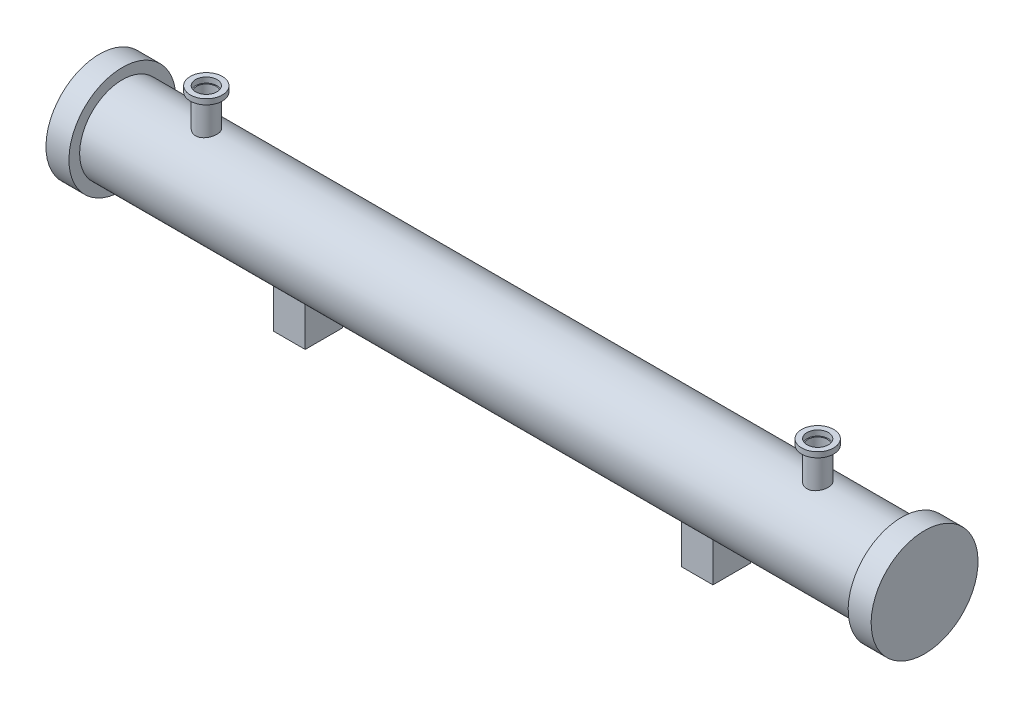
ISO-10303-21;
HEADER;
FILE_DESCRIPTION(('STEP AP214'),'2;1');
FILE_NAME('part.step','',(''),(''),'','','');
FILE_SCHEMA(('AUTOMOTIVE_DESIGN { 1 0 10303 214 1 1 1 1 }'));
ENDSEC;
DATA;
#1=APPLICATION_CONTEXT('core data for automotive mechanical design processes');
#2=APPLICATION_PROTOCOL_DEFINITION('international standard','automotive_design',2000,#1);
#3=PRODUCT_CONTEXT('',#1,'mechanical');
#4=PRODUCT('Part','Part','',(#3));
#5=PRODUCT_RELATED_PRODUCT_CATEGORY('part','',(#4));
#6=PRODUCT_DEFINITION_FORMATION('','',#4);
#7=PRODUCT_DEFINITION_CONTEXT('part definition',#1,'design');
#8=PRODUCT_DEFINITION('design','',#6,#7);
#9=PRODUCT_DEFINITION_SHAPE('','',#8);
#10=(LENGTH_UNIT() NAMED_UNIT(*) SI_UNIT(.MILLI.,.METRE.));
#11=(NAMED_UNIT(*) PLANE_ANGLE_UNIT() SI_UNIT($,.RADIAN.));
#12=(NAMED_UNIT(*) SI_UNIT($,.STERADIAN.) SOLID_ANGLE_UNIT());
#13=UNCERTAINTY_MEASURE_WITH_UNIT(LENGTH_MEASURE(1.E-05),#10,'distance_accuracy_value','');
#14=(GEOMETRIC_REPRESENTATION_CONTEXT(3) GLOBAL_UNCERTAINTY_ASSIGNED_CONTEXT((#13)) GLOBAL_UNIT_ASSIGNED_CONTEXT((#10,
#11,#12)) REPRESENTATION_CONTEXT('',''));
#15=CARTESIAN_POINT('',(0.,0.,0.));
#16=DIRECTION('',(0.,0.,1.));
#17=DIRECTION('',(1.,0.,0.));
#18=AXIS2_PLACEMENT_3D('',#15,#16,#17);
#19=CARTESIAN_POINT('',(-889.508007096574,1.1875499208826,0.));
#20=DIRECTION('',(-1.,0.,0.));
#21=DIRECTION('',(0.,-1.,0.));
#22=AXIS2_PLACEMENT_3D('',#19,#20,#21);
#23=CYLINDRICAL_SURFACE('',#22,79.9999999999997);
#24=CARTESIAN_POINT('',(422.,79.1362510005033,-18.));
#25=CARTESIAN_POINT('',(421.501337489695,79.1362465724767,-18.0000075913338));
#26=CARTESIAN_POINT('',(421.002772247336,79.1410459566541,-17.9792701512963));
#27=CARTESIAN_POINT('',(420.009105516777,79.1600904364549,-17.8965033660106));
#28=CARTESIAN_POINT('',(419.514004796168,79.1743375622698,-17.8344651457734));
#29=CARTESIAN_POINT('',(418.530560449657,79.211874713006,-17.669517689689));
#30=CARTESIAN_POINT('',(418.042223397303,79.2351729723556,-17.566571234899));
#31=CARTESIAN_POINT('',(417.07624346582,79.2901162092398,-17.3206523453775));
#32=CARTESIAN_POINT('',(416.598600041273,79.3217607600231,-17.1776819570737));
#33=CARTESIAN_POINT('',(415.657891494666,79.3924256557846,-16.853039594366));
#34=CARTESIAN_POINT('',(415.194808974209,79.4314367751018,-16.6714159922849));
#35=CARTESIAN_POINT('',(414.285727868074,79.5157385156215,-16.2707331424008));
#36=CARTESIAN_POINT('',(413.839729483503,79.5610292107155,-16.0516734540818));
#37=CARTESIAN_POINT('',(412.96782845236,79.6566033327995,-15.5777422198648));
#38=CARTESIAN_POINT('',(412.541923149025,79.7068860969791,-15.3228754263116));
#39=CARTESIAN_POINT('',(411.712906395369,79.8110524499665,-14.7790886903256));
#40=CARTESIAN_POINT('',(411.309795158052,79.8649360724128,-14.4901684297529));
#41=CARTESIAN_POINT('',(410.522697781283,79.9757102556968,-13.8753333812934));
#42=CARTESIAN_POINT('',(410.13912096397,80.0326351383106,-13.548900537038));
#43=CARTESIAN_POINT('',(409.400711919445,80.1470900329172,-12.8651151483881));
#44=CARTESIAN_POINT('',(409.045880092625,80.2046200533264,-12.5077621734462));
#45=CARTESIAN_POINT('',(408.367185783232,80.3187174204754,-11.7643397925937));
#46=CARTESIAN_POINT('',(408.043332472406,80.3752844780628,-11.3782619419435));
#47=CARTESIAN_POINT('',(407.582647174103,80.4582080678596,-10.7797668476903));
#48=CARTESIAN_POINT('',(407.433262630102,80.4855291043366,-10.5770306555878));
#49=CARTESIAN_POINT('',(407.143040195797,80.5393547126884,-10.1653425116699));
#50=CARTESIAN_POINT('',(407.002204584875,80.5658590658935,-9.95638892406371));
#51=CARTESIAN_POINT('',(406.589848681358,80.6444522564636,-9.31595133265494));
#52=CARTESIAN_POINT('',(406.33195211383,80.6949899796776,-8.87539785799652));
#53=CARTESIAN_POINT('',(405.854296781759,80.7904953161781,-7.97349648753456));
#54=CARTESIAN_POINT('',(405.634537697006,80.8354629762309,-7.51214876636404));
#55=CARTESIAN_POINT('',(405.334886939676,80.8977532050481,-6.8072886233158));
#56=CARTESIAN_POINT('',(405.240026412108,80.917650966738,-6.57027190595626));
#57=CARTESIAN_POINT('',(405.060449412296,80.9555928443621,-6.09235303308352));
#58=CARTESIAN_POINT('',(404.975730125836,80.9736374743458,-5.85145197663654));
#59=CARTESIAN_POINT('',(404.737042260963,81.0247935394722,-5.12356999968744));
#60=CARTESIAN_POINT('',(404.598475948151,81.0549413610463,-4.63125094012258));
#61=CARTESIAN_POINT('',(404.321584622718,81.1156535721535,-3.45771243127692));
#62=CARTESIAN_POINT('',(404.201140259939,81.1424957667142,-2.77202191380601));
#63=CARTESIAN_POINT('',(404.040354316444,81.1784408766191,-1.39082445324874));
#64=CARTESIAN_POINT('',(404.000010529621,81.1875442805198,-0.695317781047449));
#65=CARTESIAN_POINT('',(403.999992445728,81.1875539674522,0.498842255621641));
#66=CARTESIAN_POINT('',(404.020744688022,81.1828753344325,0.997587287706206));
#67=CARTESIAN_POINT('',(404.10357206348,81.1642990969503,1.99161852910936));
#68=CARTESIAN_POINT('',(404.165656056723,81.1503995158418,2.48690397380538));
#69=CARTESIAN_POINT('',(404.330728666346,81.1137452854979,3.47072160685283));
#70=CARTESIAN_POINT('',(404.433754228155,81.0909826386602,3.95924728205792));
#71=CARTESIAN_POINT('',(404.679868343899,81.0372371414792,4.925608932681));
#72=CARTESIAN_POINT('',(404.822954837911,81.0062547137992,5.40344545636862));
#73=CARTESIAN_POINT('',(405.147875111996,80.936963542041,6.34455803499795));
#74=CARTESIAN_POINT('',(405.329662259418,80.8986636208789,6.80785085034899));
#75=CARTESIAN_POINT('',(405.730711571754,80.815756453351,7.71733513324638));
#76=CARTESIAN_POINT('',(405.949974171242,80.7711491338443,8.16352640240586));
#77=CARTESIAN_POINT('',(406.424348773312,80.6768379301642,9.03579192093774));
#78=CARTESIAN_POINT('',(406.67945685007,80.6271346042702,9.46186836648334));
#79=CARTESIAN_POINT('',(407.223750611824,80.5239612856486,10.2911840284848));
#80=CARTESIAN_POINT('',(407.512936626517,80.470491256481,10.6944230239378));
#81=CARTESIAN_POINT('',(408.128070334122,80.3603830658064,11.4814100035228));
#82=CARTESIAN_POINT('',(408.454510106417,80.3037090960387,11.8647684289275));
#83=CARTESIAN_POINT('',(409.138274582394,80.189514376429,12.6027402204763));
#84=CARTESIAN_POINT('',(409.495599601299,80.1319936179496,12.9573532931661));
#85=CARTESIAN_POINT('',(410.23879029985,80.0176917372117,13.6355060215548));
#86=CARTESIAN_POINT('',(410.624658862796,79.9609106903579,13.959042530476));
#87=CARTESIAN_POINT('',(411.422354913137,79.8496794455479,14.5728062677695));
#88=CARTESIAN_POINT('',(411.834182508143,79.7952292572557,14.863033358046));
#89=CARTESIAN_POINT('',(412.68606625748,79.6895796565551,15.4113671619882));
#90=CARTESIAN_POINT('',(413.126397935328,79.6384261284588,15.6690549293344));
#91=CARTESIAN_POINT('',(414.027825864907,79.5415849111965,16.1463473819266));
#92=CARTESIAN_POINT('',(414.488922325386,79.4958972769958,16.3659516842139));
#93=CARTESIAN_POINT('',(415.428599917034,79.4113595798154,16.7653600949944));
#94=CARTESIAN_POINT('',(415.907179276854,79.3725088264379,16.945168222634));
#95=CARTESIAN_POINT('',(416.878426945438,79.3028233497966,17.2635641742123));
#96=CARTESIAN_POINT('',(417.371094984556,79.2719884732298,17.402152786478));
#97=CARTESIAN_POINT('',(418.358720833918,79.2197212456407,17.6350292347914));
#98=CARTESIAN_POINT('',(418.853508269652,79.1981428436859,17.7300070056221));
#99=CARTESIAN_POINT('',(419.849617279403,79.1643182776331,17.8781819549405));
#100=CARTESIAN_POINT('',(420.350938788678,79.1520720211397,17.9313795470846));
#101=CARTESIAN_POINT('',(421.356363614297,79.1372877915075,17.9955398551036));
#102=CARTESIAN_POINT('',(421.860466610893,79.134748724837,18.0065073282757));
#103=CARTESIAN_POINT('',(422.867767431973,79.1394541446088,17.9861262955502));
#104=CARTESIAN_POINT('',(423.370965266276,79.1466985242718,17.954778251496));
#105=CARTESIAN_POINT('',(424.36301511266,79.170514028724,17.8510520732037));
#106=CARTESIAN_POINT('',(424.851956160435,79.1869016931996,17.7794808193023));
#107=CARTESIAN_POINT('',(425.82193743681,79.2283880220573,17.5964876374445));
#108=CARTESIAN_POINT('',(426.302977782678,79.2534865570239,17.4850663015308));
#109=CARTESIAN_POINT('',(427.253854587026,79.3116675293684,17.2232461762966));
#110=CARTESIAN_POINT('',(427.723690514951,79.344750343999,17.0728455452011));
#111=CARTESIAN_POINT('',(428.648959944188,79.4179528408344,16.7342176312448));
#112=CARTESIAN_POINT('',(429.10439325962,79.4580726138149,16.5459898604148));
#113=CARTESIAN_POINT('',(430.001594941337,79.5445818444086,16.1313591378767));
#114=CARTESIAN_POINT('',(430.443216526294,79.5910210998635,15.9046490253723));
#115=CARTESIAN_POINT('',(431.305845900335,79.6886013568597,15.4158040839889));
#116=CARTESIAN_POINT('',(431.726853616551,79.7397423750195,15.1536691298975));
#117=CARTESIAN_POINT('',(432.545557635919,79.8453147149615,14.595773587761));
#118=CARTESIAN_POINT('',(432.943252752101,79.8997462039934,14.300011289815));
#119=CARTESIAN_POINT('',(433.712764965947,80.0104136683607,13.6768516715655));
#120=CARTESIAN_POINT('',(434.08458170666,80.0666496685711,13.3494539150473));
#121=CARTESIAN_POINT('',(434.808105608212,80.1806954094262,12.6573575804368));
#122=CARTESIAN_POINT('',(435.159162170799,80.2385118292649,12.2919794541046));
#123=CARTESIAN_POINT('',(435.829325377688,80.3528275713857,11.5328298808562));
#124=CARTESIAN_POINT('',(436.148431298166,80.4093268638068,11.139057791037));
#125=CARTESIAN_POINT('',(436.752652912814,80.5194631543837,10.3255021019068));
#126=CARTESIAN_POINT('',(437.037753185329,80.5730988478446,9.90570683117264));
#127=CARTESIAN_POINT('',(437.438143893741,80.6502402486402,9.25894486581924));
#128=CARTESIAN_POINT('',(437.567067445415,80.6754026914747,9.04050627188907));
#129=CARTESIAN_POINT('',(437.815662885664,80.7244617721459,8.59820788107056));
#130=CARTESIAN_POINT('',(437.935332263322,80.7483580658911,8.37434663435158));
#131=CARTESIAN_POINT('',(438.280742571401,80.818018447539,7.6939333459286));
#132=CARTESIAN_POINT('',(438.492130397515,80.8616070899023,7.22977140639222));
#133=CARTESIAN_POINT('',(438.87492270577,80.9417218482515,6.28465670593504));
#134=CARTESIAN_POINT('',(439.046328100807,80.9782481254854,5.8037043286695));
#135=CARTESIAN_POINT('',(439.272275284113,81.0269271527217,5.07281457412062));
#136=CARTESIAN_POINT('',(439.342357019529,81.0421260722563,4.82779324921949));
#137=CARTESIAN_POINT('',(439.472067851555,81.0703963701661,4.33494765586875));
#138=CARTESIAN_POINT('',(439.531699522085,81.083468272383,4.08712409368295));
#139=CARTESIAN_POINT('',(439.694702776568,81.119340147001,3.34020762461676));
#140=CARTESIAN_POINT('',(439.782270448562,81.138815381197,2.83738476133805));
#141=CARTESIAN_POINT('',(439.898813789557,81.1648293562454,1.94535763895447));
#142=CARTESIAN_POINT('',(439.936738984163,81.1733361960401,1.55733731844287));
#143=CARTESIAN_POINT('',(439.987332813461,81.184696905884,0.779554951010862));
#144=CARTESIAN_POINT('',(440.000001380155,81.1875507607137,0.389792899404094));
#145=CARTESIAN_POINT('',(439.999998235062,81.18754884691,-0.498466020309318));
#146=CARTESIAN_POINT('',(439.979277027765,81.1828794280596,-0.996982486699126));
#147=CARTESIAN_POINT('',(439.89654175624,81.1643253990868,-1.99059624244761));
#148=CARTESIAN_POINT('',(439.834509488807,81.1504367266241,-2.48569192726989));
#149=CARTESIAN_POINT('',(439.669500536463,81.1137957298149,-3.46958076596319));
#150=CARTESIAN_POINT('',(439.566451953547,81.0910278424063,-3.95836128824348));
#151=CARTESIAN_POINT('',(439.320257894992,81.037264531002,-4.92518957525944));
#152=CARTESIAN_POINT('',(439.177116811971,81.0062700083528,-5.40323850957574));
#153=CARTESIAN_POINT('',(438.85210604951,80.9369595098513,-6.34461201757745));
#154=CARTESIAN_POINT('',(438.670295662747,80.8986547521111,-6.80795789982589));
#155=CARTESIAN_POINT('',(438.269188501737,80.8157359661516,-7.71755011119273));
#156=CARTESIAN_POINT('',(438.049890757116,80.7711217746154,-8.16379599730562));
#157=CARTESIAN_POINT('',(437.575496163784,80.6768076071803,-9.03605580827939));
#158=CARTESIAN_POINT('',(437.320412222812,80.6271094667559,-9.4620769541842));
#159=CARTESIAN_POINT('',(436.776177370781,80.5239479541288,-10.2912846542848));
#160=CARTESIAN_POINT('',(436.487026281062,80.4704845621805,-10.6944710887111));
#161=CARTESIAN_POINT('',(435.871966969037,80.3603897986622,-11.4813616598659));
#162=CARTESIAN_POINT('',(435.545566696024,80.3037226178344,-11.8646763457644));
#163=CARTESIAN_POINT('',(434.861901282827,80.1895430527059,-12.6025596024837));
#164=CARTESIAN_POINT('',(434.504635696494,80.1320306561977,-12.9571277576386));
#165=CARTESIAN_POINT('',(433.761425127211,80.0177240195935,-13.6353202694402));
#166=CARTESIAN_POINT('',(433.375470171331,79.9609300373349,-13.9589337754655));
#167=CARTESIAN_POINT('',(432.77719683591,79.8775043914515,-14.419271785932));
#168=CARTESIAN_POINT('',(432.574540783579,79.8499890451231,-14.5685426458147));
#169=CARTESIAN_POINT('',(432.163024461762,79.7957266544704,-14.8585433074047));
#170=CARTESIAN_POINT('',(431.954162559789,79.7689798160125,-14.9992708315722));
#171=CARTESIAN_POINT('',(431.313769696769,79.6895598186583,-15.4114705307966));
#172=CARTESIAN_POINT('',(430.873171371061,79.6383755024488,-15.6693091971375));
#173=CARTESIAN_POINT('',(429.971186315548,79.5414831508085,-16.1468441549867));
#174=CARTESIAN_POINT('',(429.509799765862,79.4957750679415,-16.366540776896));
#175=CARTESIAN_POINT('',(428.804882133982,79.4323683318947,-16.6660958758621));
#176=CARTESIAN_POINT('',(428.567848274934,79.4120976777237,-16.7609235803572));
#177=CARTESIAN_POINT('',(428.08989328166,79.3734187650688,-16.9404351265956));
#178=CARTESIAN_POINT('',(427.848973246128,79.3550099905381,-17.0251217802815));
#179=CARTESIAN_POINT('',(427.121031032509,79.3027908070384,-17.263711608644));
#180=CARTESIAN_POINT('',(426.628666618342,79.2719729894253,-17.402212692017));
#181=CARTESIAN_POINT('',(425.455516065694,79.2098941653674,-17.6788260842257));
#182=CARTESIAN_POINT('',(424.770267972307,79.1824096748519,-17.7991153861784));
#183=CARTESIAN_POINT('',(423.389950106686,79.1455914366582,-17.9596959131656));
#184=CARTESIAN_POINT('',(422.69488061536,79.1362571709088,-17.9999894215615));
#185=CARTESIAN_POINT('',(422.,79.1362510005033,-18.));
#186=B_SPLINE_CURVE_WITH_KNOTS('',3,(#24,#25,#26,#27,#28,#29,#30,#31,#32,#33,#34,#35,#36,#37,
#38,#39,#40,#41,#42,#43,#44,#45,#46,#47,#48,#49,#50,#51,#52,#53,#54,#55,#56,#57,#58,#59,#60,#61,
#62,#63,#64,#65,#66,#67,#68,#69,#70,#71,#72,#73,#74,#75,#76,#77,#78,#79,#80,#81,#82,#83,#84,#85,
#86,#87,#88,#89,#90,#91,#92,#93,#94,#95,#96,#97,#98,#99,#100,#101,#102,#103,#104,#105,#106,#107,
#108,#109,#110,#111,#112,#113,#114,#115,#116,#117,#118,#119,#120,#121,#122,#123,#124,#125,#126,
#127,#128,#129,#130,#131,#132,#133,#134,#135,#136,#137,#138,#139,#140,#141,#142,#143,#144,#145,
#146,#147,#148,#149,#150,#151,#152,#153,#154,#155,#156,#157,#158,#159,#160,#161,#162,#163,#164,
#165,#166,#167,#168,#169,#170,#171,#172,#173,#174,#175,#176,#177,#178,#179,#180,#181,#182,#183,
#184,#185),.UNSPECIFIED.,.T.,.F.,(4,2,2,2,2,2,2,2,2,2,2,2,2,2,2,2,2,2,2,2,2,2,2,2,2,2,2,2,2,2,2,
2,2,2,2,2,2,2,2,2,2,2,2,2,2,2,2,2,2,2,2,2,2,2,2,2,2,2,2,2,2,2,2,2,2,2,2,2,2,2,2,2,2,2,2,2,2,2,2,
2,4),(0.,1.49536668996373,2.99105481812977,4.48810687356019,5.98508239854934,7.48019544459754,
8.97532608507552,10.4702584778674,11.9652048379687,13.4840761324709,15.0029685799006,
16.5223093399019,17.2820377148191,18.0419677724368,19.5789470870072,21.1159134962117,
21.8839146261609,22.6517021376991,24.1867578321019,26.2719042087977,28.3569931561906,
29.8528997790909,31.3491271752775,32.8467078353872,34.3442115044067,35.8399208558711,
37.3356475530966,38.8312105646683,40.3267880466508,41.8451044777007,43.3634364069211,
44.8819219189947,46.400413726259,47.9368048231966,49.473211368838,51.0094626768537,
52.5456846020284,54.0566863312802,55.5676731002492,57.0784896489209,58.5892897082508,
60.0708124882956,61.5523132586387,63.0338840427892,64.5154739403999,66.009499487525,
67.5035303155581,68.9976371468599,70.4917645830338,72.0199103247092,73.5480906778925,
75.0769614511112,75.8414401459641,76.6061255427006,78.1398082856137,79.6734560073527,
80.4391434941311,81.2046421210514,82.7347481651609,83.9038394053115,85.0729337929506,
86.5679682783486,88.0636619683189,89.5619891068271,91.0601521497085,92.5560343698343,
94.0519553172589,95.5473380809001,97.0427286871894,98.5608571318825,100.079007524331,
101.597688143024,102.357086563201,103.116686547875,104.653887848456,106.191075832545,
106.95917576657,107.727062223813,109.26231317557,111.346149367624,113.429926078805),.UNSPECIFIED.);
#187=CARTESIAN_POINT('',(422.,79.1362510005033,-18.));
#188=VERTEX_POINT('',#187);
#189=EDGE_CURVE('E20',#188,#188,#186,.T.);
#190=ORIENTED_EDGE('',*,*,#189,.T.);
#191=EDGE_LOOP('',(#190));
#192=FACE_BOUND('',#191,.T.);
#193=ADVANCED_FACE('F16',(#192),#23,.T.);
#194=CARTESIAN_POINT('',(-889.508007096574,1.1875499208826,0.));
#195=DIRECTION('',(-1.,0.,0.));
#196=DIRECTION('',(0.,-1.,0.));
#197=AXIS2_PLACEMENT_3D('',#194,#195,#196);
#198=CYLINDRICAL_SURFACE('',#197,79.9999999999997);
#199=CARTESIAN_POINT('',(-704.,81.1875499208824,0.));
#200=CARTESIAN_POINT('',(-703.999992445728,81.1875539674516,-0.498842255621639));
#201=CARTESIAN_POINT('',(-704.020744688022,81.1828753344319,-0.997587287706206));
#202=CARTESIAN_POINT('',(-704.10357206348,81.1642990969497,-1.99161852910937));
#203=CARTESIAN_POINT('',(-704.165656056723,81.1503995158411,-2.48690397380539));
#204=CARTESIAN_POINT('',(-704.330728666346,81.1137452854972,-3.47072160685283));
#205=CARTESIAN_POINT('',(-704.433754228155,81.0909826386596,-3.9592472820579));
#206=CARTESIAN_POINT('',(-704.679868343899,81.0372371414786,-4.92560893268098));
#207=CARTESIAN_POINT('',(-704.822954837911,81.0062547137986,-5.40344545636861));
#208=CARTESIAN_POINT('',(-705.147875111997,80.9369635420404,-6.34455803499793));
#209=CARTESIAN_POINT('',(-705.329662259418,80.8986636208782,-6.80785085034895));
#210=CARTESIAN_POINT('',(-705.730711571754,80.8157564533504,-7.71733513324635));
#211=CARTESIAN_POINT('',(-705.949974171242,80.7711491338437,-8.16352640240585));
#212=CARTESIAN_POINT('',(-706.424348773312,80.6768379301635,-9.03579192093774));
#213=CARTESIAN_POINT('',(-706.67945685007,80.6271346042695,-9.46186836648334));
#214=CARTESIAN_POINT('',(-707.223750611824,80.523961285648,-10.2911840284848));
#215=CARTESIAN_POINT('',(-707.512936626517,80.4704912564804,-10.6944230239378));
#216=CARTESIAN_POINT('',(-708.128070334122,80.3603830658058,-11.4814100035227));
#217=CARTESIAN_POINT('',(-708.454510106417,80.303709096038,-11.8647684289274));
#218=CARTESIAN_POINT('',(-709.138274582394,80.1895143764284,-12.6027402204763));
#219=CARTESIAN_POINT('',(-709.495599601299,80.1319936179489,-12.9573532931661));
#220=CARTESIAN_POINT('',(-710.23879029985,80.0176917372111,-13.6355060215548));
#221=CARTESIAN_POINT('',(-710.624658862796,79.9609106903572,-13.9590425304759));
#222=CARTESIAN_POINT('',(-711.422354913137,79.8496794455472,-14.5728062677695));
#223=CARTESIAN_POINT('',(-711.834182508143,79.7952292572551,-14.863033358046));
#224=CARTESIAN_POINT('',(-712.68606625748,79.6895796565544,-15.4113671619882));
#225=CARTESIAN_POINT('',(-713.126397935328,79.6384261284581,-15.6690549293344));
#226=CARTESIAN_POINT('',(-714.027825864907,79.5415849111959,-16.1463473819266));
#227=CARTESIAN_POINT('',(-714.488922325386,79.4958972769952,-16.3659516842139));
#228=CARTESIAN_POINT('',(-715.428599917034,79.4113595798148,-16.7653600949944));
#229=CARTESIAN_POINT('',(-715.907179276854,79.3725088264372,-16.945168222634));
#230=CARTESIAN_POINT('',(-716.878426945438,79.3028233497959,-17.2635641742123));
#231=CARTESIAN_POINT('',(-717.371094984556,79.2719884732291,-17.402152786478));
#232=CARTESIAN_POINT('',(-718.358720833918,79.2197212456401,-17.6350292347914));
#233=CARTESIAN_POINT('',(-718.853508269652,79.1981428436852,-17.7300070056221));
#234=CARTESIAN_POINT('',(-719.849617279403,79.1643182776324,-17.8781819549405));
#235=CARTESIAN_POINT('',(-720.350938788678,79.152072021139,-17.9313795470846));
#236=CARTESIAN_POINT('',(-721.356363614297,79.1372877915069,-17.9955398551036));
#237=CARTESIAN_POINT('',(-721.860466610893,79.1347487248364,-18.0065073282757));
#238=CARTESIAN_POINT('',(-722.867767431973,79.1394541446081,-17.9861262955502));
#239=CARTESIAN_POINT('',(-723.370965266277,79.1466985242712,-17.954778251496));
#240=CARTESIAN_POINT('',(-724.363015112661,79.1705140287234,-17.8510520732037));
#241=CARTESIAN_POINT('',(-724.851956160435,79.1869016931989,-17.7794808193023));
#242=CARTESIAN_POINT('',(-725.82193743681,79.2283880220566,-17.5964876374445));
#243=CARTESIAN_POINT('',(-726.302977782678,79.2534865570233,-17.4850663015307));
#244=CARTESIAN_POINT('',(-727.253854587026,79.3116675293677,-17.2232461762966));
#245=CARTESIAN_POINT('',(-727.723690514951,79.3447503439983,-17.072845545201));
#246=CARTESIAN_POINT('',(-728.648959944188,79.4179528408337,-16.7342176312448));
#247=CARTESIAN_POINT('',(-729.10439325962,79.4580726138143,-16.5459898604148));
#248=CARTESIAN_POINT('',(-730.001594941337,79.5445818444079,-16.1313591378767));
#249=CARTESIAN_POINT('',(-730.443216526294,79.5910210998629,-15.9046490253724));
#250=CARTESIAN_POINT('',(-731.305845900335,79.688601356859,-15.415804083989));
#251=CARTESIAN_POINT('',(-731.726853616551,79.7397423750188,-15.1536691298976));
#252=CARTESIAN_POINT('',(-732.545557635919,79.8453147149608,-14.595773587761));
#253=CARTESIAN_POINT('',(-732.943252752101,79.8997462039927,-14.300011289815));
#254=CARTESIAN_POINT('',(-733.712764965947,80.01041366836,-13.6768516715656));
#255=CARTESIAN_POINT('',(-734.08458170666,80.0666496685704,-13.3494539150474));
#256=CARTESIAN_POINT('',(-734.808105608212,80.1806954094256,-12.6573575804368));
#257=CARTESIAN_POINT('',(-735.159162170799,80.2385118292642,-12.2919794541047));
#258=CARTESIAN_POINT('',(-735.829325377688,80.352827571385,-11.5328298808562));
#259=CARTESIAN_POINT('',(-736.148431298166,80.4093268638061,-11.139057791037));
#260=CARTESIAN_POINT('',(-736.752652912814,80.519463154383,-10.3255021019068));
#261=CARTESIAN_POINT('',(-737.037753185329,80.5730988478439,-9.90570683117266));
#262=CARTESIAN_POINT('',(-737.438143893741,80.6502402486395,-9.25894486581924));
#263=CARTESIAN_POINT('',(-737.567067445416,80.675402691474,-9.04050627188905));
#264=CARTESIAN_POINT('',(-737.815662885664,80.7244617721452,-8.59820788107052));
#265=CARTESIAN_POINT('',(-737.935332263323,80.7483580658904,-8.37434663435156));
#266=CARTESIAN_POINT('',(-738.280742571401,80.8180184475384,-7.6939333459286));
#267=CARTESIAN_POINT('',(-738.492130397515,80.8616070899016,-7.22977140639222));
#268=CARTESIAN_POINT('',(-738.87492270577,80.9417218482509,-6.28465670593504));
#269=CARTESIAN_POINT('',(-739.046328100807,80.9782481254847,-5.80370432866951));
#270=CARTESIAN_POINT('',(-739.272275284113,81.026927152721,-5.07281457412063));
#271=CARTESIAN_POINT('',(-739.342357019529,81.0421260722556,-4.82779324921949));
#272=CARTESIAN_POINT('',(-739.472067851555,81.0703963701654,-4.33494765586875));
#273=CARTESIAN_POINT('',(-739.531699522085,81.0834682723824,-4.08712409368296));
#274=CARTESIAN_POINT('',(-739.694702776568,81.1193401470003,-3.34020762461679));
#275=CARTESIAN_POINT('',(-739.782270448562,81.1388153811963,-2.83738476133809));
#276=CARTESIAN_POINT('',(-739.898813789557,81.1648293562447,-1.9453576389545));
#277=CARTESIAN_POINT('',(-739.936738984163,81.1733361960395,-1.55733731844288));
#278=CARTESIAN_POINT('',(-739.987332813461,81.1846969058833,-0.779554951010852));
#279=CARTESIAN_POINT('',(-740.000001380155,81.187550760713,-0.389792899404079));
#280=CARTESIAN_POINT('',(-739.999998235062,81.1875488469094,0.498466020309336));
#281=CARTESIAN_POINT('',(-739.979277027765,81.1828794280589,0.996982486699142));
#282=CARTESIAN_POINT('',(-739.89654175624,81.1643253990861,1.99059624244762));
#283=CARTESIAN_POINT('',(-739.834509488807,81.1504367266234,2.4856919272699));
#284=CARTESIAN_POINT('',(-739.669500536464,81.1137957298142,3.46958076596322));
#285=CARTESIAN_POINT('',(-739.566451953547,81.0910278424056,3.95836128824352));
#286=CARTESIAN_POINT('',(-739.320257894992,81.0372645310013,4.92518957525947));
#287=CARTESIAN_POINT('',(-739.177116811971,81.0062700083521,5.40323850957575));
#288=CARTESIAN_POINT('',(-738.85210604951,80.9369595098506,6.34461201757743));
#289=CARTESIAN_POINT('',(-738.670295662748,80.8986547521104,6.80795789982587));
#290=CARTESIAN_POINT('',(-738.269188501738,80.8157359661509,7.71755011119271));
#291=CARTESIAN_POINT('',(-738.049890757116,80.7711217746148,8.1637959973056));
#292=CARTESIAN_POINT('',(-737.575496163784,80.6768076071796,9.0360558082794));
#293=CARTESIAN_POINT('',(-737.320412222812,80.6271094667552,9.46207695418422));
#294=CARTESIAN_POINT('',(-736.776177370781,80.5239479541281,10.2912846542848));
#295=CARTESIAN_POINT('',(-736.487026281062,80.4704845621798,10.694471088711));
#296=CARTESIAN_POINT('',(-735.871966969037,80.3603897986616,11.4813616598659));
#297=CARTESIAN_POINT('',(-735.545566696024,80.3037226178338,11.8646763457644));
#298=CARTESIAN_POINT('',(-734.861901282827,80.1895430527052,12.6025596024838));
#299=CARTESIAN_POINT('',(-734.504635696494,80.132030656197,12.9571277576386));
#300=CARTESIAN_POINT('',(-733.761425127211,80.0177240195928,13.6353202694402));
#301=CARTESIAN_POINT('',(-733.375470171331,79.9609300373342,13.9589337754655));
#302=CARTESIAN_POINT('',(-732.77719683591,79.8775043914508,14.419271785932));
#303=CARTESIAN_POINT('',(-732.574540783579,79.8499890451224,14.5685426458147));
#304=CARTESIAN_POINT('',(-732.163024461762,79.7957266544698,14.8585433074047));
#305=CARTESIAN_POINT('',(-731.954162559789,79.7689798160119,14.9992708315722));
#306=CARTESIAN_POINT('',(-731.313769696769,79.6895598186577,15.4114705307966));
#307=CARTESIAN_POINT('',(-730.873171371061,79.6383755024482,15.6693091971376));
#308=CARTESIAN_POINT('',(-729.971186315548,79.5414831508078,16.1468441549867));
#309=CARTESIAN_POINT('',(-729.509799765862,79.4957750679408,16.366540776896));
#310=CARTESIAN_POINT('',(-728.804882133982,79.4323683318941,16.6660958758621));
#311=CARTESIAN_POINT('',(-728.567848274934,79.412097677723,16.7609235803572));
#312=CARTESIAN_POINT('',(-728.08989328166,79.3734187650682,16.9404351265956));
#313=CARTESIAN_POINT('',(-727.848973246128,79.3550099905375,17.0251217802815));
#314=CARTESIAN_POINT('',(-727.12103103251,79.3027908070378,17.263711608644));
#315=CARTESIAN_POINT('',(-726.628666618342,79.2719729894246,17.4022126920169));
#316=CARTESIAN_POINT('',(-725.455516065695,79.2098941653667,17.6788260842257));
#317=CARTESIAN_POINT('',(-724.770267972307,79.1824096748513,17.7991153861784));
#318=CARTESIAN_POINT('',(-723.389950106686,79.1455914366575,17.9596959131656));
#319=CARTESIAN_POINT('',(-722.694880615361,79.1362571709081,17.9999894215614));
#320=CARTESIAN_POINT('',(-721.501337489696,79.136246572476,18.0000075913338));
#321=CARTESIAN_POINT('',(-721.002772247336,79.1410459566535,17.9792701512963));
#322=CARTESIAN_POINT('',(-720.009105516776,79.1600904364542,17.8965033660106));
#323=CARTESIAN_POINT('',(-719.514004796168,79.1743375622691,17.8344651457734));
#324=CARTESIAN_POINT('',(-718.530560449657,79.2118747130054,17.669517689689));
#325=CARTESIAN_POINT('',(-718.042223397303,79.2351729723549,17.5665712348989));
#326=CARTESIAN_POINT('',(-717.07624346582,79.2901162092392,17.3206523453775));
#327=CARTESIAN_POINT('',(-716.598600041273,79.3217607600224,17.1776819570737));
#328=CARTESIAN_POINT('',(-715.657891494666,79.392425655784,16.8530395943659));
#329=CARTESIAN_POINT('',(-715.194808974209,79.4314367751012,16.6714159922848));
#330=CARTESIAN_POINT('',(-714.285727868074,79.5157385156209,16.2707331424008));
#331=CARTESIAN_POINT('',(-713.839729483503,79.5610292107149,16.0516734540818));
#332=CARTESIAN_POINT('',(-712.96782845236,79.6566033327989,15.5777422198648));
#333=CARTESIAN_POINT('',(-712.541923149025,79.7068860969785,15.3228754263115));
#334=CARTESIAN_POINT('',(-711.712906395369,79.8110524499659,14.7790886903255));
#335=CARTESIAN_POINT('',(-711.309795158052,79.8649360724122,14.4901684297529));
#336=CARTESIAN_POINT('',(-710.522697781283,79.9757102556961,13.8753333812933));
#337=CARTESIAN_POINT('',(-710.13912096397,80.03263513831,13.5489005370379));
#338=CARTESIAN_POINT('',(-709.400711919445,80.1470900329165,12.865115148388));
#339=CARTESIAN_POINT('',(-709.045880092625,80.2046200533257,12.5077621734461));
#340=CARTESIAN_POINT('',(-708.367185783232,80.3187174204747,11.7643397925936));
#341=CARTESIAN_POINT('',(-708.043332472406,80.3752844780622,11.3782619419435));
#342=CARTESIAN_POINT('',(-707.582647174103,80.4582080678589,10.7797668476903));
#343=CARTESIAN_POINT('',(-707.433262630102,80.485529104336,10.5770306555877));
#344=CARTESIAN_POINT('',(-707.143040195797,80.5393547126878,10.1653425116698));
#345=CARTESIAN_POINT('',(-707.002204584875,80.5658590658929,9.95638892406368));
#346=CARTESIAN_POINT('',(-706.589848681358,80.644452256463,9.31595133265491));
#347=CARTESIAN_POINT('',(-706.33195211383,80.694989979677,8.87539785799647));
#348=CARTESIAN_POINT('',(-705.854296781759,80.7904953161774,7.9734964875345));
#349=CARTESIAN_POINT('',(-705.634537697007,80.8354629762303,7.512148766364));
#350=CARTESIAN_POINT('',(-705.334886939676,80.8977532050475,6.80728862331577));
#351=CARTESIAN_POINT('',(-705.240026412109,80.9176509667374,6.57027190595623));
#352=CARTESIAN_POINT('',(-705.060449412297,80.9555928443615,6.09235303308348));
#353=CARTESIAN_POINT('',(-704.975730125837,80.9736374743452,5.8514519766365));
#354=CARTESIAN_POINT('',(-704.737042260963,81.0247935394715,5.12356999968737));
#355=CARTESIAN_POINT('',(-704.598475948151,81.0549413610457,4.63125094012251));
#356=CARTESIAN_POINT('',(-704.321584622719,81.1156535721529,3.45771243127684));
#357=CARTESIAN_POINT('',(-704.201140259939,81.1424957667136,2.77202191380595));
#358=CARTESIAN_POINT('',(-704.040354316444,81.1784408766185,1.3908244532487));
#359=CARTESIAN_POINT('',(-704.000010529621,81.1875442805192,0.695317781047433));
#360=CARTESIAN_POINT('',(-704.,81.1875499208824,0.));
#361=B_SPLINE_CURVE_WITH_KNOTS('',3,(#199,#200,#201,#202,#203,#204,#205,#206,#207,#208,#209,
#210,#211,#212,#213,#214,#215,#216,#217,#218,#219,#220,#221,#222,#223,#224,#225,#226,#227,#228,
#229,#230,#231,#232,#233,#234,#235,#236,#237,#238,#239,#240,#241,#242,#243,#244,#245,#246,#247,
#248,#249,#250,#251,#252,#253,#254,#255,#256,#257,#258,#259,#260,#261,#262,#263,#264,#265,#266,
#267,#268,#269,#270,#271,#272,#273,#274,#275,#276,#277,#278,#279,#280,#281,#282,#283,#284,#285,
#286,#287,#288,#289,#290,#291,#292,#293,#294,#295,#296,#297,#298,#299,#300,#301,#302,#303,#304,
#305,#306,#307,#308,#309,#310,#311,#312,#313,#314,#315,#316,#317,#318,#319,#320,#321,#322,#323,
#324,#325,#326,#327,#328,#329,#330,#331,#332,#333,#334,#335,#336,#337,#338,#339,#340,#341,#342,
#343,#344,#345,#346,#347,#348,#349,#350,#351,#352,#353,#354,#355,#356,#357,#358,#359,#360),
.UNSPECIFIED.,.T.,.F.,(4,2,2,2,2,2,2,2,2,2,2,2,2,2,2,2,2,2,2,2,2,2,2,2,2,2,2,2,2,2,2,2,2,2,2,2,
2,2,2,2,2,2,2,2,2,2,2,2,2,2,2,2,2,2,2,2,2,2,2,2,2,2,2,2,2,2,2,2,2,2,2,2,2,2,2,2,2,2,2,2,4),(0.,
1.49590662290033,2.99213401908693,4.4897146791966,5.98721834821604,7.48292769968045,
8.97865439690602,10.4742174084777,11.9697948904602,13.48811132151,15.0064432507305,
16.524928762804,18.0434205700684,19.579811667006,21.1162182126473,22.652469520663,
24.1886914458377,25.6996931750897,27.2106799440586,28.7214964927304,30.2322965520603,
31.7138193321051,33.1953201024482,34.6768908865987,36.1584807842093,37.6525063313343,
39.1465371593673,40.6406439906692,42.1347714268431,43.6629171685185,45.1910975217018,
46.7199682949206,47.4844469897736,48.2491323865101,49.7828151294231,51.3164628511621,
52.0821503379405,52.8476489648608,54.3777550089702,55.546846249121,56.71594063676,
58.2109751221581,59.7066688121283,61.2049959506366,62.7031589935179,64.1990412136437,
65.6949621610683,67.1903449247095,68.6857355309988,70.2038639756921,71.7220143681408,
73.2406949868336,74.0000934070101,74.7596933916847,76.296894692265,77.8340826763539,
78.6021826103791,79.3700690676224,80.9053200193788,82.9891562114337,85.072932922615,
86.5682996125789,88.0639877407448,89.5610397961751,91.0580153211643,92.5531283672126,
94.0482590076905,95.5431914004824,97.0381377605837,98.5570090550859,100.075901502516,
101.595242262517,102.354970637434,103.114900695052,104.651880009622,106.188846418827,
106.956847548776,107.724635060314,109.259690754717,111.344837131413,113.429926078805),.UNSPECIFIED.);
#362=CARTESIAN_POINT('',(-704.,81.1875499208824,0.));
#363=VERTEX_POINT('',#362);
#364=EDGE_CURVE('E275',#363,#363,#361,.T.);
#365=ORIENTED_EDGE('',*,*,#364,.T.);
#366=EDGE_LOOP('',(#365));
#367=FACE_BOUND('',#366,.T.);
#368=ADVANCED_FACE('F282',(#367),#198,.T.);
#369=CARTESIAN_POINT('',(422.,140.000000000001,0.));
#370=DIRECTION('',(0.,1.,0.));
#371=DIRECTION('',(-1.,0.,0.));
#372=AXIS2_PLACEMENT_3D('',#369,#370,#371);
#373=CYLINDRICAL_SURFACE('',#372,18.);
#374=ORIENTED_EDGE('',*,*,#189,.F.);
#375=EDGE_LOOP('',(#374));
#376=FACE_BOUND('',#375,.T.);
#377=CARTESIAN_POINT('',(422.,140.000000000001,0.));
#378=DIRECTION('',(0.,1.,0.));
#379=DIRECTION('',(-1.,0.,0.));
#380=AXIS2_PLACEMENT_3D('',#377,#378,#379);
#381=CIRCLE('',#380,18.);
#382=CARTESIAN_POINT('',(404.,140.000000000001,0.));
#383=VERTEX_POINT('',#382);
#384=EDGE_CURVE('E280',#383,#383,#381,.T.);
#385=ORIENTED_EDGE('',*,*,#384,.T.);
#386=EDGE_LOOP('',(#385));
#387=FACE_BOUND('',#386,.T.);
#388=ADVANCED_FACE('F272',(#376,#387),#373,.F.);
#389=CARTESIAN_POINT('',(-722.,140.,0.));
#390=DIRECTION('',(0.,-1.,0.));
#391=DIRECTION('',(0.,0.,-1.));
#392=AXIS2_PLACEMENT_3D('',#389,#390,#391);
#393=CYLINDRICAL_SURFACE('',#392,18.);
#394=CARTESIAN_POINT('',(-722.,140.,0.));
#395=DIRECTION('',(0.,-1.,0.));
#396=DIRECTION('',(0.,0.,-1.));
#397=AXIS2_PLACEMENT_3D('',#394,#395,#396);
#398=CIRCLE('',#397,18.);
#399=CARTESIAN_POINT('',(-722.,140.,-18.));
#400=VERTEX_POINT('',#399);
#401=EDGE_CURVE('E302',#400,#400,#398,.F.);
#402=ORIENTED_EDGE('',*,*,#401,.T.);
#403=EDGE_LOOP('',(#402));
#404=FACE_BOUND('',#403,.T.);
#405=ORIENTED_EDGE('',*,*,#364,.F.);
#406=EDGE_LOOP('',(#405));
#407=FACE_BOUND('',#406,.T.);
#408=ADVANCED_FACE('F268',(#404,#407),#393,.F.);
#409=CARTESIAN_POINT('',(422.,140.000000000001,0.));
#410=DIRECTION('',(0.,-1.,0.));
#411=DIRECTION('',(1.,0.,0.));
#412=AXIS2_PLACEMENT_3D('',#409,#410,#411);
#413=PLANE('',#412);
#414=CARTESIAN_POINT('',(422.,140.000000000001,0.));
#415=DIRECTION('',(0.,-1.,0.));
#416=DIRECTION('',(1.,0.,0.));
#417=AXIS2_PLACEMENT_3D('',#414,#415,#416);
#418=CIRCLE('',#417,30.);
#419=CARTESIAN_POINT('',(452.,140.000000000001,0.));
#420=VERTEX_POINT('',#419);
#421=EDGE_CURVE('E304',#420,#420,#418,.F.);
#422=ORIENTED_EDGE('',*,*,#421,.T.);
#423=EDGE_LOOP('',(#422));
#424=FACE_BOUND('',#423,.T.);
#425=ORIENTED_EDGE('',*,*,#384,.F.);
#426=EDGE_LOOP('',(#425));
#427=FACE_BOUND('',#426,.T.);
#428=ADVANCED_FACE('F264',(#424,#427),#413,.F.);
#429=CARTESIAN_POINT('',(-722.,140.,0.));
#430=DIRECTION('',(0.,-1.,0.));
#431=DIRECTION('',(0.,0.,-1.));
#432=AXIS2_PLACEMENT_3D('',#429,#430,#431);
#433=PLANE('',#432);
#434=CARTESIAN_POINT('',(-722.,140.,0.));
#435=DIRECTION('',(0.,1.,0.));
#436=DIRECTION('',(0.,0.,1.));
#437=AXIS2_PLACEMENT_3D('',#434,#435,#436);
#438=CIRCLE('',#437,30.);
#439=CARTESIAN_POINT('',(-722.,140.,30.));
#440=VERTEX_POINT('',#439);
#441=EDGE_CURVE('E307',#440,#440,#438,.T.);
#442=ORIENTED_EDGE('',*,*,#441,.T.);
#443=EDGE_LOOP('',(#442));
#444=FACE_BOUND('',#443,.T.);
#445=ORIENTED_EDGE('',*,*,#401,.F.);
#446=EDGE_LOOP('',(#445));
#447=FACE_BOUND('',#446,.T.);
#448=ADVANCED_FACE('F260',(#444,#447),#433,.F.);
#449=CARTESIAN_POINT('',(422.,140.000000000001,0.));
#450=DIRECTION('',(0.,-1.,0.));
#451=DIRECTION('',(1.,0.,0.));
#452=AXIS2_PLACEMENT_3D('',#449,#450,#451);
#453=CYLINDRICAL_SURFACE('',#452,30.);
#454=CARTESIAN_POINT('',(422.,150.000000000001,0.));
#455=DIRECTION('',(0.,-1.,0.));
#456=DIRECTION('',(1.,0.,0.));
#457=AXIS2_PLACEMENT_3D('',#454,#455,#456);
#458=CIRCLE('',#457,30.);
#459=CARTESIAN_POINT('',(452.,150.000000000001,0.));
#460=VERTEX_POINT('',#459);
#461=EDGE_CURVE('E312',#460,#460,#458,.T.);
#462=ORIENTED_EDGE('',*,*,#461,.F.);
#463=EDGE_LOOP('',(#462));
#464=FACE_BOUND('',#463,.T.);
#465=ORIENTED_EDGE('',*,*,#421,.F.);
#466=EDGE_LOOP('',(#465));
#467=FACE_BOUND('',#466,.T.);
#468=ADVANCED_FACE('F256',(#464,#467),#453,.F.);
#469=CARTESIAN_POINT('',(-722.,140.,0.));
#470=DIRECTION('',(0.,1.,0.));
#471=DIRECTION('',(0.,0.,1.));
#472=AXIS2_PLACEMENT_3D('',#469,#470,#471);
#473=CYLINDRICAL_SURFACE('',#472,30.);
#474=ORIENTED_EDGE('',*,*,#441,.F.);
#475=EDGE_LOOP('',(#474));
#476=FACE_BOUND('',#475,.T.);
#477=CARTESIAN_POINT('',(-722.,150.,0.));
#478=DIRECTION('',(0.,1.,0.));
#479=DIRECTION('',(0.,0.,1.));
#480=AXIS2_PLACEMENT_3D('',#477,#478,#479);
#481=CIRCLE('',#480,30.);
#482=CARTESIAN_POINT('',(-722.,150.,30.));
#483=VERTEX_POINT('',#482);
#484=EDGE_CURVE('E315',#483,#483,#481,.F.);
#485=ORIENTED_EDGE('',*,*,#484,.F.);
#486=EDGE_LOOP('',(#485));
#487=FACE_BOUND('',#486,.T.);
#488=ADVANCED_FACE('F252',(#476,#487),#473,.F.);
#489=CARTESIAN_POINT('',(622.,-48.8124500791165,0.));
#490=DIRECTION('',(1.,0.,0.));
#491=DIRECTION('',(0.,0.,-1.));
#492=AXIS2_PLACEMENT_3D('',#489,#490,#491);
#493=PLANE('',#492);
#494=CARTESIAN_POINT('',(622.,1.18754992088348,0.));
#495=DIRECTION('',(-1.,0.,0.));
#496=DIRECTION('',(0.,-1.,0.));
#497=AXIS2_PLACEMENT_3D('',#494,#495,#496);
#498=CIRCLE('',#497,100.);
#499=CARTESIAN_POINT('',(622.,-98.8124500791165,0.));
#500=VERTEX_POINT('',#499);
#501=EDGE_CURVE('E318',#500,#500,#498,.T.);
#502=ORIENTED_EDGE('',*,*,#501,.F.);
#503=EDGE_LOOP('',(#502));
#504=FACE_BOUND('',#503,.T.);
#505=ADVANCED_FACE('F248',(#504),#493,.T.);
#506=CARTESIAN_POINT('',(422.,150.000000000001,0.));
#507=DIRECTION('',(0.,-1.,0.));
#508=DIRECTION('',(1.,0.,0.));
#509=AXIS2_PLACEMENT_3D('',#506,#507,#508);
#510=PLANE('',#509);
#511=ORIENTED_EDGE('',*,*,#461,.T.);
#512=EDGE_LOOP('',(#511));
#513=FACE_BOUND('',#512,.T.);
#514=CARTESIAN_POINT('',(422.,150.000000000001,0.));
#515=DIRECTION('',(0.,-1.,0.));
#516=DIRECTION('',(1.,0.,0.));
#517=AXIS2_PLACEMENT_3D('',#514,#515,#516);
#518=CIRCLE('',#517,20.);
#519=CARTESIAN_POINT('',(442.,150.000000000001,0.));
#520=VERTEX_POINT('',#519);
#521=EDGE_CURVE('E321',#520,#520,#518,.T.);
#522=ORIENTED_EDGE('',*,*,#521,.F.);
#523=EDGE_LOOP('',(#522));
#524=FACE_BOUND('',#523,.T.);
#525=ADVANCED_FACE('F244',(#513,#524),#510,.T.);
#526=CARTESIAN_POINT('',(-722.,150.,0.));
#527=DIRECTION('',(0.,-1.,0.));
#528=DIRECTION('',(0.,0.,-1.));
#529=AXIS2_PLACEMENT_3D('',#526,#527,#528);
#530=PLANE('',#529);
#531=ORIENTED_EDGE('',*,*,#484,.T.);
#532=EDGE_LOOP('',(#531));
#533=FACE_BOUND('',#532,.T.);
#534=CARTESIAN_POINT('',(-722.,150.,0.));
#535=DIRECTION('',(0.,1.,0.));
#536=DIRECTION('',(0.,0.,1.));
#537=AXIS2_PLACEMENT_3D('',#534,#535,#536);
#538=CIRCLE('',#537,20.);
#539=CARTESIAN_POINT('',(-722.,150.,20.));
#540=VERTEX_POINT('',#539);
#541=EDGE_CURVE('E324',#540,#540,#538,.F.);
#542=ORIENTED_EDGE('',*,*,#541,.F.);
#543=EDGE_LOOP('',(#542));
#544=FACE_BOUND('',#543,.T.);
#545=ADVANCED_FACE('F240',(#533,#544),#530,.T.);
#546=CARTESIAN_POINT('',(-922.,-48.8124500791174,0.));
#547=DIRECTION('',(-1.,0.,0.));
#548=DIRECTION('',(0.,-1.,0.));
#549=AXIS2_PLACEMENT_3D('',#546,#547,#548);
#550=PLANE('',#549);
#551=CARTESIAN_POINT('',(-922.,1.18754992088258,0.));
#552=DIRECTION('',(-1.,0.,0.));
#553=DIRECTION('',(0.,-1.,0.));
#554=AXIS2_PLACEMENT_3D('',#551,#552,#553);
#555=CIRCLE('',#554,100.);
#556=CARTESIAN_POINT('',(-922.,-98.8124500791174,0.));
#557=VERTEX_POINT('',#556);
#558=EDGE_CURVE('E105',#557,#557,#555,.F.);
#559=ORIENTED_EDGE('',*,*,#558,.F.);
#560=EDGE_LOOP('',(#559));
#561=FACE_BOUND('',#560,.T.);
#562=ADVANCED_FACE('F232',(#561),#550,.T.);
#563=CARTESIAN_POINT('',(600.508007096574,1.18754992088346,0.));
#564=DIRECTION('',(-1.,0.,0.));
#565=DIRECTION('',(0.,-1.,0.));
#566=AXIS2_PLACEMENT_3D('',#563,#564,#565);
#567=CYLINDRICAL_SURFACE('',#566,100.);
#568=CARTESIAN_POINT('',(579.016014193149,1.18754992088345,0.));
#569=DIRECTION('',(-1.,0.,0.));
#570=DIRECTION('',(0.,-1.,0.));
#571=AXIS2_PLACEMENT_3D('',#568,#569,#570);
#572=CIRCLE('',#571,100.);
#573=CARTESIAN_POINT('',(579.016014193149,-98.8124500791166,0.));
#574=VERTEX_POINT('',#573);
#575=EDGE_CURVE('E115',#574,#574,#572,.T.);
#576=ORIENTED_EDGE('',*,*,#575,.F.);
#577=EDGE_LOOP('',(#576));
#578=FACE_BOUND('',#577,.T.);
#579=ORIENTED_EDGE('',*,*,#501,.T.);
#580=EDGE_LOOP('',(#579));
#581=FACE_BOUND('',#580,.T.);
#582=ADVANCED_FACE('F224',(#578,#581),#567,.T.);
#583=CARTESIAN_POINT('',(-900.508007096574,1.1875499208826,0.));
#584=DIRECTION('',(-1.,0.,0.));
#585=DIRECTION('',(0.,-1.,0.));
#586=AXIS2_PLACEMENT_3D('',#583,#584,#585);
#587=CYLINDRICAL_SURFACE('',#586,100.);
#588=ORIENTED_EDGE('',*,*,#558,.T.);
#589=EDGE_LOOP('',(#588));
#590=FACE_BOUND('',#589,.T.);
#591=CARTESIAN_POINT('',(-879.016014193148,1.18754992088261,0.));
#592=DIRECTION('',(-1.,0.,0.));
#593=DIRECTION('',(0.,-1.,0.));
#594=AXIS2_PLACEMENT_3D('',#591,#592,#593);
#595=CIRCLE('',#594,100.);
#596=CARTESIAN_POINT('',(-879.016014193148,-98.8124500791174,0.));
#597=VERTEX_POINT('',#596);
#598=EDGE_CURVE('E112',#597,#597,#595,.F.);
#599=ORIENTED_EDGE('',*,*,#598,.F.);
#600=EDGE_LOOP('',(#599));
#601=FACE_BOUND('',#600,.T.);
#602=ADVANCED_FACE('F222',(#590,#601),#587,.T.);
#603=CARTESIAN_POINT('',(-531.5,-150.,-17.5));
#604=DIRECTION('',(0.,1.,0.));
#605=DIRECTION('',(0.,0.,1.));
#606=AXIS2_PLACEMENT_3D('',#603,#604,#605);
#607=PLANE('',#606);
#608=DIRECTION('',(-1.,0.,0.));
#609=VECTOR('',#608,1.);
#610=CARTESIAN_POINT('',(-561.,-150.,-35.));
#611=LINE('',#610,#609);
#612=CARTESIAN_POINT('',(-502.,-150.,-35.));
#613=VERTEX_POINT('',#612);
#614=CARTESIAN_POINT('',(-561.,-150.,-35.));
#615=VERTEX_POINT('',#614);
#616=EDGE_CURVE('E78',#613,#615,#611,.T.);
#617=ORIENTED_EDGE('',*,*,#616,.F.);
#618=DIRECTION('',(0.,0.,-1.));
#619=VECTOR('',#618,1.);
#620=CARTESIAN_POINT('',(-502.,-150.,-35.));
#621=LINE('',#620,#619);
#622=CARTESIAN_POINT('',(-502.,-150.,35.));
#623=VERTEX_POINT('',#622);
#624=EDGE_CURVE('E150',#623,#613,#621,.T.);
#625=ORIENTED_EDGE('',*,*,#624,.F.);
#626=DIRECTION('',(1.,0.,0.));
#627=VECTOR('',#626,1.);
#628=CARTESIAN_POINT('',(-502.,-150.,35.));
#629=LINE('',#628,#627);
#630=CARTESIAN_POINT('',(-561.,-150.,35.));
#631=VERTEX_POINT('',#630);
#632=EDGE_CURVE('E86',#631,#623,#629,.T.);
#633=ORIENTED_EDGE('',*,*,#632,.F.);
#634=DIRECTION('',(0.,0.,1.));
#635=VECTOR('',#634,1.);
#636=CARTESIAN_POINT('',(-561.,-150.,0.));
#637=LINE('',#636,#635);
#638=EDGE_CURVE('E107',#615,#631,#637,.T.);
#639=ORIENTED_EDGE('',*,*,#638,.F.);
#640=EDGE_LOOP('',(#617,#625,#633,#639));
#641=FACE_BOUND('',#640,.T.);
#642=ADVANCED_FACE('F108',(#641),#607,.F.);
#643=CARTESIAN_POINT('',(-561.,-150.,-35.));
#644=DIRECTION('',(0.,0.,-1.));
#645=DIRECTION('',(-1.,0.,0.));
#646=AXIS2_PLACEMENT_3D('',#643,#644,#645);
#647=PLANE('',#646);
#648=ORIENTED_EDGE('',*,*,#616,.T.);
#649=DIRECTION('',(0.,1.,0.));
#650=VECTOR('',#649,1.);
#651=CARTESIAN_POINT('',(-561.,-150.,-35.));
#652=LINE('',#651,#650);
#653=CARTESIAN_POINT('',(-561.,-70.7499229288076,-35.));
#654=VERTEX_POINT('',#653);
#655=EDGE_CURVE('E101',#654,#615,#652,.F.);
#656=ORIENTED_EDGE('',*,*,#655,.F.);
#657=DIRECTION('',(-1.,0.,0.));
#658=VECTOR('',#657,1.);
#659=CARTESIAN_POINT('',(-889.508007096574,-70.7499229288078,-35.));
#660=LINE('',#659,#658);
#661=CARTESIAN_POINT('',(-502.,-70.7499229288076,-35.));
#662=VERTEX_POINT('',#661);
#663=EDGE_CURVE('E126',#662,#654,#660,.T.);
#664=ORIENTED_EDGE('',*,*,#663,.F.);
#665=DIRECTION('',(0.,1.,0.));
#666=VECTOR('',#665,1.);
#667=CARTESIAN_POINT('',(-502.,-150.,-35.));
#668=LINE('',#667,#666);
#669=EDGE_CURVE('E102',#613,#662,#668,.T.);
#670=ORIENTED_EDGE('',*,*,#669,.F.);
#671=EDGE_LOOP('',(#648,#656,#664,#670));
#672=FACE_BOUND('',#671,.T.);
#673=ADVANCED_FACE('F99',(#672),#647,.T.);
#674=CARTESIAN_POINT('',(231.5,-150.,-17.5));
#675=DIRECTION('',(0.,1.,0.));
#676=DIRECTION('',(0.,0.,1.));
#677=AXIS2_PLACEMENT_3D('',#674,#675,#676);
#678=PLANE('',#677);
#679=DIRECTION('',(1.,0.,0.));
#680=VECTOR('',#679,1.);
#681=CARTESIAN_POINT('',(202.,-150.,35.));
#682=LINE('',#681,#680);
#683=CARTESIAN_POINT('',(202.,-150.,35.));
#684=VERTEX_POINT('',#683);
#685=CARTESIAN_POINT('',(261.,-150.,35.));
#686=VERTEX_POINT('',#685);
#687=EDGE_CURVE('E136',#684,#686,#682,.T.);
#688=ORIENTED_EDGE('',*,*,#687,.F.);
#689=DIRECTION('',(0.,0.,1.));
#690=VECTOR('',#689,1.);
#691=CARTESIAN_POINT('',(202.,-150.,-35.));
#692=LINE('',#691,#690);
#693=CARTESIAN_POINT('',(202.,-150.,-35.));
#694=VERTEX_POINT('',#693);
#695=EDGE_CURVE('E141',#694,#684,#692,.T.);
#696=ORIENTED_EDGE('',*,*,#695,.F.);
#697=DIRECTION('',(-1.,0.,0.));
#698=VECTOR('',#697,1.);
#699=CARTESIAN_POINT('',(261.,-150.,-35.));
#700=LINE('',#699,#698);
#701=CARTESIAN_POINT('',(261.,-150.,-35.));
#702=VERTEX_POINT('',#701);
#703=EDGE_CURVE('E104',#702,#694,#700,.T.);
#704=ORIENTED_EDGE('',*,*,#703,.F.);
#705=DIRECTION('',(0.,0.,-1.));
#706=VECTOR('',#705,1.);
#707=CARTESIAN_POINT('',(261.,-150.,0.));
#708=LINE('',#707,#706);
#709=EDGE_CURVE('E130',#686,#702,#708,.T.);
#710=ORIENTED_EDGE('',*,*,#709,.F.);
#711=EDGE_LOOP('',(#688,#696,#704,#710));
#712=FACE_BOUND('',#711,.T.);
#713=ADVANCED_FACE('F367',(#712),#678,.F.);
#714=CARTESIAN_POINT('',(261.,-150.,-35.));
#715=DIRECTION('',(0.,0.,-1.));
#716=DIRECTION('',(-1.,0.,0.));
#717=AXIS2_PLACEMENT_3D('',#714,#715,#716);
#718=PLANE('',#717);
#719=ORIENTED_EDGE('',*,*,#703,.T.);
#720=DIRECTION('',(0.,-1.,0.));
#721=VECTOR('',#720,1.);
#722=CARTESIAN_POINT('',(202.,-150.,-35.));
#723=LINE('',#722,#721);
#724=CARTESIAN_POINT('',(202.,-70.7499229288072,-35.));
#725=VERTEX_POINT('',#724);
#726=EDGE_CURVE('E144',#725,#694,#723,.T.);
#727=ORIENTED_EDGE('',*,*,#726,.F.);
#728=DIRECTION('',(-1.,0.,0.));
#729=VECTOR('',#728,1.);
#730=CARTESIAN_POINT('',(-889.508007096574,-70.7499229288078,-35.));
#731=LINE('',#730,#729);
#732=CARTESIAN_POINT('',(261.,-70.7499229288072,-35.));
#733=VERTEX_POINT('',#732);
#734=EDGE_CURVE('E123',#733,#725,#731,.T.);
#735=ORIENTED_EDGE('',*,*,#734,.F.);
#736=DIRECTION('',(0.,1.,0.));
#737=VECTOR('',#736,1.);
#738=CARTESIAN_POINT('',(261.,-150.,-35.));
#739=LINE('',#738,#737);
#740=EDGE_CURVE('E133',#702,#733,#739,.T.);
#741=ORIENTED_EDGE('',*,*,#740,.F.);
#742=EDGE_LOOP('',(#719,#727,#735,#741));
#743=FACE_BOUND('',#742,.T.);
#744=ADVANCED_FACE('F369',(#743),#718,.T.);
#745=CARTESIAN_POINT('',(579.016014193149,-88.8124500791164,0.));
#746=DIRECTION('',(-1.,0.,0.));
#747=DIRECTION('',(0.,-1.,0.));
#748=AXIS2_PLACEMENT_3D('',#745,#746,#747);
#749=PLANE('',#748);
#750=CARTESIAN_POINT('',(579.016014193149,1.18754992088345,0.));
#751=DIRECTION('',(-1.,0.,0.));
#752=DIRECTION('',(0.,-1.,0.));
#753=AXIS2_PLACEMENT_3D('',#750,#751,#752);
#754=CIRCLE('',#753,79.9999999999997);
#755=CARTESIAN_POINT('',(579.016014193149,-78.8124500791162,0.));
#756=VERTEX_POINT('',#755);
#757=EDGE_CURVE('E329',#756,#756,#754,.T.);
#758=ORIENTED_EDGE('',*,*,#757,.F.);
#759=EDGE_LOOP('',(#758));
#760=FACE_BOUND('',#759,.T.);
#761=ORIENTED_EDGE('',*,*,#575,.T.);
#762=EDGE_LOOP('',(#761));
#763=FACE_BOUND('',#762,.T.);
#764=ADVANCED_FACE('F371',(#760,#763),#749,.T.);
#765=CARTESIAN_POINT('',(422.,140.000000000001,0.));
#766=DIRECTION('',(0.,1.,0.));
#767=DIRECTION('',(-1.,0.,0.));
#768=AXIS2_PLACEMENT_3D('',#765,#766,#767);
#769=CYLINDRICAL_SURFACE('',#768,20.);
#770=ORIENTED_EDGE('',*,*,#521,.T.);
#771=EDGE_LOOP('',(#770));
#772=FACE_BOUND('',#771,.T.);
#773=CARTESIAN_POINT('',(442.,81.187549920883,0.));
#774=CARTESIAN_POINT('',(442.000008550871,81.1875550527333,0.552506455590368));
#775=CARTESIAN_POINT('',(441.97709641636,81.1818156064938,1.10490169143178));
#776=CARTESIAN_POINT('',(441.885655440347,81.1590273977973,2.20584057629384));
#777=CARTESIAN_POINT('',(441.817117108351,81.1419762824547,2.75438339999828));
#778=CARTESIAN_POINT('',(441.634905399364,81.0970096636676,3.84394369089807));
#779=CARTESIAN_POINT('',(441.521192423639,81.069084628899,4.38495412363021));
#780=CARTESIAN_POINT('',(441.24958508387,81.0031447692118,5.45510743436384));
#781=CARTESIAN_POINT('',(441.091692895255,80.9651304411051,5.9842508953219));
#782=CARTESIAN_POINT('',(440.733236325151,80.8801085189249,7.02631135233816));
#783=CARTESIAN_POINT('',(440.532730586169,80.8331132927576,7.53924954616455));
#784=CARTESIAN_POINT('',(440.09045646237,80.7313638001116,8.54621502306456));
#785=CARTESIAN_POINT('',(439.848687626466,80.6766094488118,9.04024209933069));
#786=CARTESIAN_POINT('',(439.325685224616,80.5608097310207,10.0061091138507));
#787=CARTESIAN_POINT('',(439.044455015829,80.4997648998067,10.4779509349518));
#788=CARTESIAN_POINT('',(438.444484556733,80.3729976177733,11.3964845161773));
#789=CARTESIAN_POINT('',(438.125743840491,80.3072751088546,11.8431759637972));
#790=CARTESIAN_POINT('',(437.446654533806,80.171639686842,12.7166237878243));
#791=CARTESIAN_POINT('',(437.085644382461,80.1016716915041,13.1428573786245));
#792=CARTESIAN_POINT('',(436.329358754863,79.960594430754,13.9635549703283));
#793=CARTESIAN_POINT('',(435.934082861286,79.8894851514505,14.3580185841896));
#794=CARTESIAN_POINT('',(435.111810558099,79.7480715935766,15.1126388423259));
#795=CARTESIAN_POINT('',(434.684810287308,79.6777674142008,15.4727912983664));
#796=CARTESIAN_POINT('',(433.801902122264,79.5399257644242,16.156323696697));
#797=CARTESIAN_POINT('',(433.345994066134,79.4723883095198,16.4797034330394));
#798=CARTESIAN_POINT('',(432.401245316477,79.3410136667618,17.0919758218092));
#799=CARTESIAN_POINT('',(431.912015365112,79.2772465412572,17.3802833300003));
#800=CARTESIAN_POINT('',(430.910151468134,79.156412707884,17.914560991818));
#801=CARTESIAN_POINT('',(430.397517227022,79.099346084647,18.1605306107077));
#802=CARTESIAN_POINT('',(429.352486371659,78.9936480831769,18.6081705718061));
#803=CARTESIAN_POINT('',(428.820092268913,78.9450156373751,18.8098465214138));
#804=CARTESIAN_POINT('',(427.739311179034,78.8576834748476,19.1672700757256));
#805=CARTESIAN_POINT('',(427.190924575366,78.8189835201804,19.3230187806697));
#806=CARTESIAN_POINT('',(426.093325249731,78.7534010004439,19.5846004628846));
#807=CARTESIAN_POINT('',(425.544349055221,78.7262972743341,19.6913707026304));
#808=CARTESIAN_POINT('',(424.438941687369,78.6836366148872,19.8586006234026));
#809=CARTESIAN_POINT('',(423.882510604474,78.6680795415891,19.9190608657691));
#810=CARTESIAN_POINT('',(422.766411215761,78.6489990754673,19.993132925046));
#811=CARTESIAN_POINT('',(422.206743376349,78.6454739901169,20.0067513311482));
#812=CARTESIAN_POINT('',(421.088295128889,78.6505636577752,19.9870360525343));
#813=CARTESIAN_POINT('',(420.529514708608,78.6591782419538,19.9537030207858));
#814=CARTESIAN_POINT('',(419.430541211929,78.6879221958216,19.8417619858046));
#815=CARTESIAN_POINT('',(418.89022625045,78.7077669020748,19.7642729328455));
#816=CARTESIAN_POINT('',(417.818227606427,78.7581664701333,19.5655294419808));
#817=CARTESIAN_POINT('',(417.286543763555,78.7887211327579,19.4442758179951));
#818=CARTESIAN_POINT('',(416.235432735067,78.8596506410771,19.1589756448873));
#819=CARTESIAN_POINT('',(415.716006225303,78.9000260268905,18.9949267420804));
#820=CARTESIAN_POINT('',(414.692911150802,78.9894381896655,18.6253134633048));
#821=CARTESIAN_POINT('',(414.189242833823,79.0384751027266,18.4197484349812));
#822=CARTESIAN_POINT('',(413.195947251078,79.1443648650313,17.9663494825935));
#823=CARTESIAN_POINT('',(412.706513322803,79.2012916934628,17.7181093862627));
#824=CARTESIAN_POINT('',(411.750228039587,79.3209789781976,17.1826218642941));
#825=CARTESIAN_POINT('',(411.283376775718,79.3837394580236,16.8953742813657));
#826=CARTESIAN_POINT('',(410.375164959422,79.5133740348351,16.283824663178));
#827=CARTESIAN_POINT('',(409.933806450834,79.5802484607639,15.959519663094));
#828=CARTESIAN_POINT('',(409.07936864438,79.7163012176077,15.2760142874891));
#829=CARTESIAN_POINT('',(408.666289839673,79.7854795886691,14.9168133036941));
#830=CARTESIAN_POINT('',(407.859703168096,79.9262686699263,14.1551522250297));
#831=CARTESIAN_POINT('',(407.467082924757,79.9978927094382,13.7517540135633));
#832=CARTESIAN_POINT('',(406.71710207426,80.1396323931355,12.9131513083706));
#833=CARTESIAN_POINT('',(406.359742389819,80.2097479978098,12.4779459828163));
#834=CARTESIAN_POINT('',(405.68259530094,80.3465523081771,11.5784007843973));
#835=CARTESIAN_POINT('',(405.362824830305,80.4132394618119,11.1140479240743));
#836=CARTESIAN_POINT('',(404.76333925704,80.5412939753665,10.1594858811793));
#837=CARTESIAN_POINT('',(404.483622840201,80.6026615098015,9.6692775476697));
#838=CARTESIAN_POINT('',(403.96524055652,80.7186031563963,8.66420798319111));
#839=CARTESIAN_POINT('',(403.726751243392,80.7731477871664,8.14925223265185));
#840=CARTESIAN_POINT('',(403.294118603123,80.8735944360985,7.10013900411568));
#841=CARTESIAN_POINT('',(403.09998049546,80.9194954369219,6.56597927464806));
#842=CARTESIAN_POINT('',(402.758017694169,81.0012477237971,5.4834065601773));
#843=CARTESIAN_POINT('',(402.610105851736,81.037117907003,4.93502253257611));
#844=CARTESIAN_POINT('',(402.361421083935,81.0978696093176,3.82729967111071));
#845=CARTESIAN_POINT('',(402.260626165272,81.1227562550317,3.26796607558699));
#846=CARTESIAN_POINT('',(402.122645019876,81.1569555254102,2.25726498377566));
#847=CARTESIAN_POINT('',(402.07667775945,81.168409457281,1.8071471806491));
#848=CARTESIAN_POINT('',(402.015354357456,81.1837071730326,0.9046971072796));
#849=CARTESIAN_POINT('',(401.999998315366,81.1875509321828,0.452364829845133));
#850=CARTESIAN_POINT('',(402.000002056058,81.1875486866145,-0.552101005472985));
#851=CARTESIAN_POINT('',(402.022880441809,81.1818204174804,-1.10425049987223));
#852=CARTESIAN_POINT('',(402.114222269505,81.1590588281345,-2.20474026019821));
#853=CARTESIAN_POINT('',(402.18270523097,81.14202066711,-2.75307879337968));
#854=CARTESIAN_POINT('',(402.364848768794,81.0970697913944,-3.84271573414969));
#855=CARTESIAN_POINT('',(402.478586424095,81.069138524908,-4.38400049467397));
#856=CARTESIAN_POINT('',(402.750279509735,81.0031774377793,-5.45465608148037));
#857=CARTESIAN_POINT('',(402.908230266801,80.9651486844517,-5.98402816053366));
#858=CARTESIAN_POINT('',(403.266783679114,80.8801037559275,-7.02636886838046));
#859=CARTESIAN_POINT('',(403.467314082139,80.8331028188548,-7.53936361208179));
#860=CARTESIAN_POINT('',(403.909649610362,80.7313395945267,-8.54644415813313));
#861=CARTESIAN_POINT('',(404.151455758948,80.6765771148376,-9.04052949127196));
#862=CARTESIAN_POINT('',(404.674479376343,80.5607738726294,-10.0063904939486));
#863=CARTESIAN_POINT('',(404.955683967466,80.4997351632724,-10.478173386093));
#864=CARTESIAN_POINT('',(405.555591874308,80.3729818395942,-11.396591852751));
#865=CARTESIAN_POINT('',(405.874295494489,80.3072671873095,-11.8432272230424));
#866=CARTESIAN_POINT('',(406.553305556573,80.1716477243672,-12.7165717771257));
#867=CARTESIAN_POINT('',(406.914273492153,80.1016878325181,-13.1427583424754));
#868=CARTESIAN_POINT('',(407.670452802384,79.9606287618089,-13.9633603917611));
#869=CARTESIAN_POINT('',(408.065664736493,79.889529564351,-14.3577753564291));
#870=CARTESIAN_POINT('',(408.887959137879,79.7481101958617,-15.1124390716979));
#871=CARTESIAN_POINT('',(409.315053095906,79.6777903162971,-15.4726753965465));
#872=CARTESIAN_POINT('',(409.977233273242,79.5744068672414,-15.9853391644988));
#873=CARTESIAN_POINT('',(410.201558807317,79.5402938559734,-16.1516177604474));
#874=CARTESIAN_POINT('',(410.657127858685,79.472989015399,-16.4747460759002));
#875=CARTESIAN_POINT('',(410.88837321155,79.4397974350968,-16.6315932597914));
#876=CARTESIAN_POINT('',(411.598934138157,79.3409892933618,-17.0920897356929));
#877=CARTESIAN_POINT('',(412.088457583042,79.2771842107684,-17.3805643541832));
#878=CARTESIAN_POINT('',(413.090931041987,79.1562874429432,-17.9151094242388));
#879=CARTESIAN_POINT('',(413.603880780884,79.0991956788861,-18.161180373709));
#880=CARTESIAN_POINT('',(414.387833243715,79.0199175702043,-18.4969106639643));
#881=CARTESIAN_POINT('',(414.651484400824,78.9945586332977,-18.6032290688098));
#882=CARTESIAN_POINT('',(415.183181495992,78.9461437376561,-18.8045683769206));
#883=CARTESIAN_POINT('',(415.451226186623,78.9230871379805,-18.8995924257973));
#884=CARTESIAN_POINT('',(416.26130219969,78.8576433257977,-19.1674357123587));
#885=CARTESIAN_POINT('',(416.809455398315,78.8189637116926,-19.3231031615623));
#886=CARTESIAN_POINT('',(417.742377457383,78.7632159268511,-19.5454490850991));
#887=CARTESIAN_POINT('',(418.124050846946,78.743180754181,-19.6247043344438));
#888=CARTESIAN_POINT('',(418.891610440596,78.7086129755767,-19.7608134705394));
#889=CARTESIAN_POINT('',(419.277496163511,78.6940797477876,-19.8176698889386));
#890=CARTESIAN_POINT('',(420.052134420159,78.6707370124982,-19.9087400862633));
#891=CARTESIAN_POINT('',(420.440887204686,78.6619280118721,-19.9429518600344));
#892=CARTESIAN_POINT('',(421.219746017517,78.6501675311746,-19.988581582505));
#893=CARTESIAN_POINT('',(421.609851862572,78.6472152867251,-20.0000025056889));
#894=CARTESIAN_POINT('',(422.552090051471,78.6472190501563,-19.9999964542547));
#895=CARTESIAN_POINT('',(423.104264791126,78.6531360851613,-19.9771181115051));
#896=CARTESIAN_POINT('',(424.204649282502,78.6766310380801,-19.8857855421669));
#897=CARTESIAN_POINT('',(424.752858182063,78.6942113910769,-19.8173217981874));
#898=CARTESIAN_POINT('',(425.841771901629,78.7405193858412,-19.6353188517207));
#899=CARTESIAN_POINT('',(426.382469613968,78.7692569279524,-19.5217396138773));
#900=CARTESIAN_POINT('',(427.451982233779,78.8370138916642,-19.250461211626));
#901=CARTESIAN_POINT('',(427.980797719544,78.8760328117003,-19.092764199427));
#902=CARTESIAN_POINT('',(429.022169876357,78.9631373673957,-18.7347764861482));
#903=CARTESIAN_POINT('',(429.534748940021,79.0112098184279,-18.5345476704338));
#904=CARTESIAN_POINT('',(430.54102497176,79.115071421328,-18.0928941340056));
#905=CARTESIAN_POINT('',(431.034721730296,79.1708606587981,-17.8514689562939));
#906=CARTESIAN_POINT('',(431.999971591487,79.2885739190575,-17.3292139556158));
#907=CARTESIAN_POINT('',(432.471526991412,79.3504973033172,-17.0483882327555));
#908=CARTESIAN_POINT('',(433.38956122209,79.4787721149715,-16.4492657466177));
#909=CARTESIAN_POINT('',(433.836039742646,79.5451235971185,-16.1309685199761));
#910=CARTESIAN_POINT('',(434.709695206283,79.6817949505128,-15.4523659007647));
#911=CARTESIAN_POINT('',(435.136314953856,79.7521673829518,-15.0913535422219));
#912=CARTESIAN_POINT('',(435.957798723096,79.8936894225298,-14.3349782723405));
#913=CARTESIAN_POINT('',(436.352662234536,79.9648390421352,-13.9396148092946));
#914=CARTESIAN_POINT('',(437.108149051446,80.1059785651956,-13.117003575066));
#915=CARTESIAN_POINT('',(437.46876191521,80.1759681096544,-12.6897461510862));
#916=CARTESIAN_POINT('',(438.153174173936,80.3128466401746,-11.8062363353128));
#917=CARTESIAN_POINT('',(438.476973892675,80.3797356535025,-11.3499841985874));
#918=CARTESIAN_POINT('',(439.089878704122,80.5095073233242,-10.404704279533));
#919=CARTESIAN_POINT('',(439.378418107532,80.5723185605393,-9.91529960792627));
#920=CARTESIAN_POINT('',(439.913138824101,80.6910879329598,-8.91303035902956));
#921=CARTESIAN_POINT('',(440.159317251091,80.7470456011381,-8.40016418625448));
#922=CARTESIAN_POINT('',(440.607121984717,80.8504491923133,-7.35511894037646));
#923=CARTESIAN_POINT('',(440.808794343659,80.8979039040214,-6.822960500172));
#924=CARTESIAN_POINT('',(441.166197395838,80.9829951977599,-5.74286626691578));
#925=CARTESIAN_POINT('',(441.321939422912,81.0206342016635,-5.19493440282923));
#926=CARTESIAN_POINT('',(441.634999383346,81.0968849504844,-3.88255645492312));
#927=CARTESIAN_POINT('',(441.771698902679,81.1307321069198,-3.11281352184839));
#928=CARTESIAN_POINT('',(441.954191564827,81.1760605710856,-1.56197273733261));
#929=CARTESIAN_POINT('',(441.999987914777,81.1875426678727,-0.780875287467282));
#930=CARTESIAN_POINT('',(442.,81.187549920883,0.));
#931=B_SPLINE_CURVE_WITH_KNOTS('',3,(#773,#774,#775,#776,#777,#778,#779,#780,#781,#782,#783,
#784,#785,#786,#787,#788,#789,#790,#791,#792,#793,#794,#795,#796,#797,#798,#799,#800,#801,#802,
#803,#804,#805,#806,#807,#808,#809,#810,#811,#812,#813,#814,#815,#816,#817,#818,#819,#820,#821,
#822,#823,#824,#825,#826,#827,#828,#829,#830,#831,#832,#833,#834,#835,#836,#837,#838,#839,#840,
#841,#842,#843,#844,#845,#846,#847,#848,#849,#850,#851,#852,#853,#854,#855,#856,#857,#858,#859,
#860,#861,#862,#863,#864,#865,#866,#867,#868,#869,#870,#871,#872,#873,#874,#875,#876,#877,#878,
#879,#880,#881,#882,#883,#884,#885,#886,#887,#888,#889,#890,#891,#892,#893,#894,#895,#896,#897,
#898,#899,#900,#901,#902,#903,#904,#905,#906,#907,#908,#909,#910,#911,#912,#913,#914,#915,#916,
#917,#918,#919,#920,#921,#922,#923,#924,#925,#926,#927,#928,#929,#930),.UNSPECIFIED.,.T.,.F.,(4,
2,2,2,2,2,2,2,2,2,2,2,2,2,2,2,2,2,2,2,2,2,2,2,2,2,2,2,2,2,2,2,2,2,2,2,2,2,2,2,2,2,2,2,2,2,2,2,2,
2,2,2,2,2,2,2,2,2,2,2,2,2,2,2,2,2,2,2,2,2,2,2,2,2,2,2,2,2,4),(0.,1.65682406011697,
3.31399285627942,4.97261749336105,6.63116047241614,8.28743566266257,9.94372896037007,
11.5998814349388,13.2560544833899,14.9429169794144,16.629800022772,18.3168887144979,
20.0039868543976,21.716203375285,23.4284415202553,25.1404627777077,26.8524430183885,
28.5301347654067,30.2078061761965,31.8852415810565,33.5626536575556,35.1993373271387,
36.8359905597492,38.4727338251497,40.1095028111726,41.7628128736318,43.4161296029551,
45.0695787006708,46.7230566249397,48.4234408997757,50.1238696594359,51.8250615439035,
53.5261975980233,55.2344473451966,56.9428980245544,58.6481081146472,60.3525214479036,
61.7092691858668,63.0660213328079,64.7219065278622,66.3785009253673,68.0379290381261,
69.6971818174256,71.3536412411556,73.0101417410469,74.6661020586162,76.3220758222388,
78.0087360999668,79.6954239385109,81.3827226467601,82.226436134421,83.0703754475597,
84.7834844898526,86.4965734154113,87.35256422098,88.2083160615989,89.9192318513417,
91.0896054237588,92.2598466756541,93.4301915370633,94.6003836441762,96.2562967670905,
97.912555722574,99.5702877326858,101.227938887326,102.883194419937,104.538468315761,
106.193570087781,107.848692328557,109.536585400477,111.224505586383,112.912938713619,
114.60135698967,116.314047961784,118.026855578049,119.737882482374,121.448486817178,
123.790212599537,126.1318557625),.UNSPECIFIED.);
#932=CARTESIAN_POINT('',(442.,81.187549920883,0.));
#933=VERTEX_POINT('',#932);
#934=EDGE_CURVE('E176',#933,#933,#931,.T.);
#935=ORIENTED_EDGE('',*,*,#934,.F.);
#936=EDGE_LOOP('',(#935));
#937=FACE_BOUND('',#936,.T.);
#938=ADVANCED_FACE('F216',(#772,#937),#769,.T.);
#939=CARTESIAN_POINT('',(-722.,140.,0.));
#940=DIRECTION('',(0.,-1.,0.));
#941=DIRECTION('',(0.,0.,-1.));
#942=AXIS2_PLACEMENT_3D('',#939,#940,#941);
#943=CYLINDRICAL_SURFACE('',#942,20.);
#944=ORIENTED_EDGE('',*,*,#541,.T.);
#945=EDGE_LOOP('',(#944));
#946=FACE_BOUND('',#945,.T.);
#947=CARTESIAN_POINT('',(-702.,81.1875499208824,0.));
#948=CARTESIAN_POINT('',(-702.000002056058,81.1875486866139,0.552101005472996));
#949=CARTESIAN_POINT('',(-702.02288044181,81.1818204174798,1.10425049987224));
#950=CARTESIAN_POINT('',(-702.114222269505,81.1590588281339,2.20474026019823));
#951=CARTESIAN_POINT('',(-702.18270523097,81.1420206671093,2.7530787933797));
#952=CARTESIAN_POINT('',(-702.364848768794,81.0970697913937,3.84271573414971));
#953=CARTESIAN_POINT('',(-702.478586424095,81.0691385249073,4.38400049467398));
#954=CARTESIAN_POINT('',(-702.750279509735,81.0031774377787,5.45465608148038));
#955=CARTESIAN_POINT('',(-702.908230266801,80.9651486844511,5.98402816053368));
#956=CARTESIAN_POINT('',(-703.266783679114,80.8801037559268,7.02636886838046));
#957=CARTESIAN_POINT('',(-703.46731408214,80.8331028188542,7.53936361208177));
#958=CARTESIAN_POINT('',(-703.909649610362,80.7313395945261,8.54644415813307));
#959=CARTESIAN_POINT('',(-704.151455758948,80.6765771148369,9.04052949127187));
#960=CARTESIAN_POINT('',(-704.674479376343,80.5607738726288,10.0063904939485));
#961=CARTESIAN_POINT('',(-704.955683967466,80.4997351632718,10.4781733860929));
#962=CARTESIAN_POINT('',(-705.555591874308,80.3729818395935,11.3965918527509));
#963=CARTESIAN_POINT('',(-705.874295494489,80.3072671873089,11.8432272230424));
#964=CARTESIAN_POINT('',(-706.553305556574,80.1716477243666,12.7165717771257));
#965=CARTESIAN_POINT('',(-706.914273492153,80.1016878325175,13.1427583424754));
#966=CARTESIAN_POINT('',(-707.670452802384,79.9606287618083,13.9633603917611));
#967=CARTESIAN_POINT('',(-708.065664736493,79.8895295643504,14.3577753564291));
#968=CARTESIAN_POINT('',(-708.88795913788,79.7481101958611,15.1124390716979));
#969=CARTESIAN_POINT('',(-709.315053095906,79.6777903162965,15.4726753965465));
#970=CARTESIAN_POINT('',(-709.977233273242,79.5744068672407,15.9853391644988));
#971=CARTESIAN_POINT('',(-710.201558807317,79.5402938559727,16.1516177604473));
#972=CARTESIAN_POINT('',(-710.657127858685,79.4729890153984,16.4747460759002));
#973=CARTESIAN_POINT('',(-710.88837321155,79.4397974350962,16.6315932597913));
#974=CARTESIAN_POINT('',(-711.598934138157,79.3409892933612,17.0920897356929));
#975=CARTESIAN_POINT('',(-712.088457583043,79.2771842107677,17.3805643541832));
#976=CARTESIAN_POINT('',(-713.090931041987,79.1562874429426,17.9151094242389));
#977=CARTESIAN_POINT('',(-713.603880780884,79.0991956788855,18.161180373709));
#978=CARTESIAN_POINT('',(-714.387833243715,79.0199175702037,18.4969106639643));
#979=CARTESIAN_POINT('',(-714.651484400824,78.994558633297,18.6032290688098));
#980=CARTESIAN_POINT('',(-715.183181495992,78.9461437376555,18.8045683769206));
#981=CARTESIAN_POINT('',(-715.451226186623,78.9230871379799,18.8995924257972));
#982=CARTESIAN_POINT('',(-716.26130219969,78.857643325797,19.1674357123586));
#983=CARTESIAN_POINT('',(-716.809455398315,78.818963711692,19.3231031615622));
#984=CARTESIAN_POINT('',(-717.742377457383,78.7632159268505,19.5454490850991));
#985=CARTESIAN_POINT('',(-718.124050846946,78.7431807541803,19.6247043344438));
#986=CARTESIAN_POINT('',(-718.891610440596,78.7086129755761,19.7608134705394));
#987=CARTESIAN_POINT('',(-719.277496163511,78.6940797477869,19.8176698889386));
#988=CARTESIAN_POINT('',(-720.052134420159,78.6707370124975,19.9087400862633));
#989=CARTESIAN_POINT('',(-720.440887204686,78.6619280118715,19.9429518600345));
#990=CARTESIAN_POINT('',(-721.219746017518,78.6501675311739,19.988581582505));
#991=CARTESIAN_POINT('',(-721.609851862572,78.6472152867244,20.0000025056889));
#992=CARTESIAN_POINT('',(-722.552090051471,78.6472190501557,19.9999964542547));
#993=CARTESIAN_POINT('',(-723.104264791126,78.6531360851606,19.9771181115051));
#994=CARTESIAN_POINT('',(-724.204649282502,78.6766310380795,19.8857855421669));
#995=CARTESIAN_POINT('',(-724.752858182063,78.6942113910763,19.8173217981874));
#996=CARTESIAN_POINT('',(-725.841771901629,78.7405193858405,19.6353188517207));
#997=CARTESIAN_POINT('',(-726.382469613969,78.7692569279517,19.5217396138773));
#998=CARTESIAN_POINT('',(-727.451982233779,78.8370138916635,19.2504612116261));
#999=CARTESIAN_POINT('',(-727.980797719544,78.8760328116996,19.092764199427));
#1000=CARTESIAN_POINT('',(-729.022169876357,78.963137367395,18.7347764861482));
#1001=CARTESIAN_POINT('',(-729.534748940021,79.0112098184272,18.5345476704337));
#1002=CARTESIAN_POINT('',(-730.54102497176,79.1150714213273,18.0928941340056));
#1003=CARTESIAN_POINT('',(-731.034721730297,79.1708606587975,17.8514689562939));
#1004=CARTESIAN_POINT('',(-731.999971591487,79.2885739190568,17.3292139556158));
#1005=CARTESIAN_POINT('',(-732.471526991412,79.3504973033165,17.0483882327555));
#1006=CARTESIAN_POINT('',(-733.38956122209,79.4787721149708,16.4492657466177));
#1007=CARTESIAN_POINT('',(-733.836039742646,79.5451235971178,16.1309685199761));
#1008=CARTESIAN_POINT('',(-734.709695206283,79.6817949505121,15.4523659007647));
#1009=CARTESIAN_POINT('',(-735.136314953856,79.7521673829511,15.0913535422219));
#1010=CARTESIAN_POINT('',(-735.957798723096,79.8936894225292,14.3349782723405));
#1011=CARTESIAN_POINT('',(-736.352662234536,79.9648390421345,13.9396148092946));
#1012=CARTESIAN_POINT('',(-737.108149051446,80.1059785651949,13.1170035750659));
#1013=CARTESIAN_POINT('',(-737.46876191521,80.1759681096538,12.6897461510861));
#1014=CARTESIAN_POINT('',(-738.153174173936,80.3128466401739,11.8062363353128));
#1015=CARTESIAN_POINT('',(-738.476973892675,80.3797356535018,11.3499841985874));
#1016=CARTESIAN_POINT('',(-739.089878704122,80.5095073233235,10.404704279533));
#1017=CARTESIAN_POINT('',(-739.378418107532,80.5723185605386,9.91529960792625));
#1018=CARTESIAN_POINT('',(-739.913138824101,80.6910879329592,8.91303035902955));
#1019=CARTESIAN_POINT('',(-740.159317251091,80.7470456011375,8.40016418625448));
#1020=CARTESIAN_POINT('',(-740.607121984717,80.8504491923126,7.35511894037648));
#1021=CARTESIAN_POINT('',(-740.808794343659,80.8979039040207,6.82296050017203));
#1022=CARTESIAN_POINT('',(-741.166197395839,80.9829951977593,5.74286626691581));
#1023=CARTESIAN_POINT('',(-741.321939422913,81.0206342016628,5.19493440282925));
#1024=CARTESIAN_POINT('',(-741.634999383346,81.0968849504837,3.88255645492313));
#1025=CARTESIAN_POINT('',(-741.771698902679,81.1307321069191,3.11281352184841));
#1026=CARTESIAN_POINT('',(-741.954191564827,81.1760605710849,1.56197273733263));
#1027=CARTESIAN_POINT('',(-741.999987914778,81.187542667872,0.780875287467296));
#1028=CARTESIAN_POINT('',(-742.000008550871,81.1875550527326,-0.552506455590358));
#1029=CARTESIAN_POINT('',(-741.97709641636,81.1818156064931,-1.10490169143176));
#1030=CARTESIAN_POINT('',(-741.885655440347,81.1590273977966,-2.20584057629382));
#1031=CARTESIAN_POINT('',(-741.817117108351,81.1419762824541,-2.75438339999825));
#1032=CARTESIAN_POINT('',(-741.634905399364,81.097009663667,-3.84394369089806));
#1033=CARTESIAN_POINT('',(-741.52119242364,81.0690846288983,-4.38495412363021));
#1034=CARTESIAN_POINT('',(-741.24958508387,81.0031447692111,-5.45510743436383));
#1035=CARTESIAN_POINT('',(-741.091692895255,80.9651304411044,-5.98425089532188));
#1036=CARTESIAN_POINT('',(-740.733236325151,80.8801085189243,-7.02631135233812));
#1037=CARTESIAN_POINT('',(-740.532730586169,80.8331132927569,-7.53924954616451));
#1038=CARTESIAN_POINT('',(-740.09045646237,80.731363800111,-8.5462150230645));
#1039=CARTESIAN_POINT('',(-739.848687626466,80.6766094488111,-9.04024209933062));
#1040=CARTESIAN_POINT('',(-739.325685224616,80.56080973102,-10.0061091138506));
#1041=CARTESIAN_POINT('',(-739.044455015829,80.4997648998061,-10.4779509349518));
#1042=CARTESIAN_POINT('',(-738.444484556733,80.3729976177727,-11.3964845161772));
#1043=CARTESIAN_POINT('',(-738.125743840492,80.307275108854,-11.8431759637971));
#1044=CARTESIAN_POINT('',(-737.446654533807,80.1716396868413,-12.7166237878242));
#1045=CARTESIAN_POINT('',(-737.085644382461,80.1016716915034,-13.1428573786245));
#1046=CARTESIAN_POINT('',(-736.329358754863,79.9605944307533,-13.9635549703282));
#1047=CARTESIAN_POINT('',(-735.934082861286,79.8894851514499,-14.3580185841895));
#1048=CARTESIAN_POINT('',(-735.111810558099,79.7480715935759,-15.1126388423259));
#1049=CARTESIAN_POINT('',(-734.684810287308,79.6777674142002,-15.4727912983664));
#1050=CARTESIAN_POINT('',(-733.801902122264,79.5399257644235,-16.156323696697));
#1051=CARTESIAN_POINT('',(-733.345994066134,79.4723883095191,-16.4797034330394));
#1052=CARTESIAN_POINT('',(-732.401245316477,79.3410136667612,-17.0919758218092));
#1053=CARTESIAN_POINT('',(-731.912015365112,79.2772465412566,-17.3802833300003));
#1054=CARTESIAN_POINT('',(-730.910151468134,79.1564127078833,-17.914560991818));
#1055=CARTESIAN_POINT('',(-730.397517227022,79.0993460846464,-18.1605306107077));
#1056=CARTESIAN_POINT('',(-729.352486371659,78.9936480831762,-18.608170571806));
#1057=CARTESIAN_POINT('',(-728.820092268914,78.9450156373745,-18.8098465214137));
#1058=CARTESIAN_POINT('',(-727.739311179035,78.8576834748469,-19.1672700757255));
#1059=CARTESIAN_POINT('',(-727.190924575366,78.8189835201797,-19.3230187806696));
#1060=CARTESIAN_POINT('',(-726.093325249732,78.7534010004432,-19.5846004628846));
#1061=CARTESIAN_POINT('',(-725.544349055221,78.7262972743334,-19.6913707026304));
#1062=CARTESIAN_POINT('',(-724.438941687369,78.6836366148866,-19.8586006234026));
#1063=CARTESIAN_POINT('',(-723.882510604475,78.6680795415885,-19.9190608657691));
#1064=CARTESIAN_POINT('',(-722.766411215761,78.6489990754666,-19.993132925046));
#1065=CARTESIAN_POINT('',(-722.206743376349,78.6454739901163,-20.0067513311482));
#1066=CARTESIAN_POINT('',(-721.088295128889,78.6505636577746,-19.9870360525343));
#1067=CARTESIAN_POINT('',(-720.529514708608,78.6591782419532,-19.9537030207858));
#1068=CARTESIAN_POINT('',(-719.430541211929,78.6879221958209,-19.8417619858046));
#1069=CARTESIAN_POINT('',(-718.89022625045,78.7077669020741,-19.7642729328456));
#1070=CARTESIAN_POINT('',(-717.818227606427,78.7581664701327,-19.5655294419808));
#1071=CARTESIAN_POINT('',(-717.286543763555,78.7887211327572,-19.4442758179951));
#1072=CARTESIAN_POINT('',(-716.235432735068,78.8596506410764,-19.1589756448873));
#1073=CARTESIAN_POINT('',(-715.716006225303,78.9000260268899,-18.9949267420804));
#1074=CARTESIAN_POINT('',(-714.692911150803,78.9894381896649,-18.6253134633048));
#1075=CARTESIAN_POINT('',(-714.189242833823,79.0384751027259,-18.4197484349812));
#1076=CARTESIAN_POINT('',(-713.195947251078,79.1443648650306,-17.9663494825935));
#1077=CARTESIAN_POINT('',(-712.706513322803,79.2012916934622,-17.7181093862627));
#1078=CARTESIAN_POINT('',(-711.750228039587,79.320978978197,-17.1826218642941));
#1079=CARTESIAN_POINT('',(-711.283376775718,79.383739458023,-16.8953742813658));
#1080=CARTESIAN_POINT('',(-710.375164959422,79.5133740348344,-16.2838246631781));
#1081=CARTESIAN_POINT('',(-709.933806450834,79.5802484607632,-15.9595196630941));
#1082=CARTESIAN_POINT('',(-709.07936864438,79.7163012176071,-15.2760142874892));
#1083=CARTESIAN_POINT('',(-708.666289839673,79.7854795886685,-14.9168133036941));
#1084=CARTESIAN_POINT('',(-707.859703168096,79.9262686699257,-14.1551522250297));
#1085=CARTESIAN_POINT('',(-707.467082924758,79.9978927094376,-13.7517540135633));
#1086=CARTESIAN_POINT('',(-706.71710207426,80.1396323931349,-12.9131513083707));
#1087=CARTESIAN_POINT('',(-706.359742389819,80.2097479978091,-12.4779459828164));
#1088=CARTESIAN_POINT('',(-705.68259530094,80.3465523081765,-11.5784007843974));
#1089=CARTESIAN_POINT('',(-705.362824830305,80.4132394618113,-11.1140479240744));
#1090=CARTESIAN_POINT('',(-704.76333925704,80.5412939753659,-10.1594858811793));
#1091=CARTESIAN_POINT('',(-704.483622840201,80.6026615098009,-9.66927754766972));
#1092=CARTESIAN_POINT('',(-703.96524055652,80.7186031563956,-8.6642079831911));
#1093=CARTESIAN_POINT('',(-703.726751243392,80.7731477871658,-8.14925223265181));
#1094=CARTESIAN_POINT('',(-703.294118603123,80.8735944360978,-7.10013900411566));
#1095=CARTESIAN_POINT('',(-703.09998049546,80.9194954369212,-6.56597927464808));
#1096=CARTESIAN_POINT('',(-702.758017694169,81.0012477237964,-5.48340656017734));
#1097=CARTESIAN_POINT('',(-702.610105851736,81.0371179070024,-4.93502253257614));
#1098=CARTESIAN_POINT('',(-702.361421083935,81.0978696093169,-3.82729967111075));
#1099=CARTESIAN_POINT('',(-702.260626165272,81.1227562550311,-3.26796607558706));
#1100=CARTESIAN_POINT('',(-702.122645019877,81.1569555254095,-2.25726498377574));
#1101=CARTESIAN_POINT('',(-702.07667775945,81.1684094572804,-1.80714718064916));
#1102=CARTESIAN_POINT('',(-702.015354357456,81.183707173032,-0.904697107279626));
#1103=CARTESIAN_POINT('',(-701.999998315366,81.1875509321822,-0.45236482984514));
#1104=CARTESIAN_POINT('',(-702.,81.1875499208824,0.));
#1105=B_SPLINE_CURVE_WITH_KNOTS('',3,(#947,#948,#949,#950,#951,#952,#953,#954,#955,#956,#957,
#958,#959,#960,#961,#962,#963,#964,#965,#966,#967,#968,#969,#970,#971,#972,#973,#974,#975,#976,
#977,#978,#979,#980,#981,#982,#983,#984,#985,#986,#987,#988,#989,#990,#991,#992,#993,#994,#995,
#996,#997,#998,#999,#1000,#1001,#1002,#1003,#1004,#1005,#1006,#1007,#1008,#1009,#1010,#1011,
#1012,#1013,#1014,#1015,#1016,#1017,#1018,#1019,#1020,#1021,#1022,#1023,#1024,#1025,#1026,#1027,
#1028,#1029,#1030,#1031,#1032,#1033,#1034,#1035,#1036,#1037,#1038,#1039,#1040,#1041,#1042,#1043,
#1044,#1045,#1046,#1047,#1048,#1049,#1050,#1051,#1052,#1053,#1054,#1055,#1056,#1057,#1058,#1059,
#1060,#1061,#1062,#1063,#1064,#1065,#1066,#1067,#1068,#1069,#1070,#1071,#1072,#1073,#1074,#1075,
#1076,#1077,#1078,#1079,#1080,#1081,#1082,#1083,#1084,#1085,#1086,#1087,#1088,#1089,#1090,#1091,
#1092,#1093,#1094,#1095,#1096,#1097,#1098,#1099,#1100,#1101,#1102,#1103,#1104),.UNSPECIFIED.,
.T.,.F.,(4,2,2,2,2,2,2,2,2,2,2,2,2,2,2,2,2,2,2,2,2,2,2,2,2,2,2,2,2,2,2,2,2,2,2,2,2,2,2,2,2,2,2,
2,2,2,2,2,2,2,2,2,2,2,2,2,2,2,2,2,2,2,2,2,2,2,2,2,2,2,2,2,2,2,2,2,2,2,4),(0.,1.65588519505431,
3.31247959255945,4.97190770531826,6.63116048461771,8.2876199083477,9.94412040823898,
11.6000807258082,13.2560544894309,14.9427147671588,16.629402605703,18.3167013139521,
19.160414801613,20.0043541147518,21.7174631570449,23.4305520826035,24.2865428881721,
25.1422947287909,26.8532105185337,28.0235840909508,29.1938253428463,30.3641702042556,
31.5343623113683,33.1902754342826,34.846534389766,36.5042663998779,38.1619175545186,
39.8171730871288,41.4724469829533,43.1275487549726,44.7826709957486,46.4705640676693,
48.1584842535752,49.8469173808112,51.5353356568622,53.2480266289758,54.960834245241,
56.6718611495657,58.3824654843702,60.7241912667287,63.0658344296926,64.7226584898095,
66.379827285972,68.0384519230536,69.6969949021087,71.3532700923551,73.0095633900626,
74.6657158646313,76.3218889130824,78.0087514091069,79.6956344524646,81.3827231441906,
83.0698212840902,84.7820378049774,86.4942759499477,88.2062972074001,89.9182774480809,
91.5959691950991,93.2736406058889,94.9510760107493,96.6284880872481,98.2651717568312,
99.9018249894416,101.538568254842,103.175337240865,104.828647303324,106.481964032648,
108.135413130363,109.788891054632,111.489275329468,113.189704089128,114.890895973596,
116.592032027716,118.300281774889,120.008732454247,121.71394254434,123.418355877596,
124.775103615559,126.1318557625),.UNSPECIFIED.);
#1106=CARTESIAN_POINT('',(-702.,81.1875499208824,0.));
#1107=VERTEX_POINT('',#1106);
#1108=EDGE_CURVE('E169',#1107,#1107,#1105,.T.);
#1109=ORIENTED_EDGE('',*,*,#1108,.F.);
#1110=EDGE_LOOP('',(#1109));
#1111=FACE_BOUND('',#1110,.T.);
#1112=ADVANCED_FACE('F181',(#946,#1111),#943,.T.);
#1113=CARTESIAN_POINT('',(-879.016014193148,-88.8124500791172,0.));
#1114=DIRECTION('',(1.,0.,0.));
#1115=DIRECTION('',(0.,0.,-1.));
#1116=AXIS2_PLACEMENT_3D('',#1113,#1114,#1115);
#1117=PLANE('',#1116);
#1118=CARTESIAN_POINT('',(-879.016014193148,1.18754992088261,0.));
#1119=DIRECTION('',(-1.,0.,0.));
#1120=DIRECTION('',(0.,-1.,0.));
#1121=AXIS2_PLACEMENT_3D('',#1118,#1119,#1120);
#1122=CIRCLE('',#1121,79.9999999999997);
#1123=CARTESIAN_POINT('',(-879.016014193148,-78.8124500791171,0.));
#1124=VERTEX_POINT('',#1123);
#1125=EDGE_CURVE('E166',#1124,#1124,#1122,.F.);
#1126=ORIENTED_EDGE('',*,*,#1125,.F.);
#1127=EDGE_LOOP('',(#1126));
#1128=FACE_BOUND('',#1127,.T.);
#1129=ORIENTED_EDGE('',*,*,#598,.T.);
#1130=EDGE_LOOP('',(#1129));
#1131=FACE_BOUND('',#1130,.T.);
#1132=ADVANCED_FACE('F209',(#1128,#1131),#1117,.T.);
#1133=CARTESIAN_POINT('',(-561.,-150.,0.));
#1134=DIRECTION('',(-1.,0.,0.));
#1135=DIRECTION('',(0.,0.,1.));
#1136=AXIS2_PLACEMENT_3D('',#1133,#1134,#1135);
#1137=PLANE('',#1136);
#1138=DIRECTION('',(0.,1.,0.));
#1139=VECTOR('',#1138,1.);
#1140=CARTESIAN_POINT('',(-561.,-150.,35.));
#1141=LINE('',#1140,#1139);
#1142=CARTESIAN_POINT('',(-561.,-70.7499229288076,35.));
#1143=VERTEX_POINT('',#1142);
#1144=EDGE_CURVE('E109',#1143,#631,#1141,.F.);
#1145=ORIENTED_EDGE('',*,*,#1144,.F.);
#1146=CARTESIAN_POINT('',(-561.,1.18754992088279,0.));
#1147=DIRECTION('',(-1.,0.,0.));
#1148=DIRECTION('',(0.,-1.,0.));
#1149=AXIS2_PLACEMENT_3D('',#1146,#1147,#1148);
#1150=CIRCLE('',#1149,79.9999999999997);
#1151=EDGE_CURVE('E63',#654,#1143,#1150,.T.);
#1152=ORIENTED_EDGE('',*,*,#1151,.F.);
#1153=ORIENTED_EDGE('',*,*,#655,.T.);
#1154=ORIENTED_EDGE('',*,*,#638,.T.);
#1155=EDGE_LOOP('',(#1145,#1152,#1153,#1154));
#1156=FACE_BOUND('',#1155,.T.);
#1157=ADVANCED_FACE('F111',(#1156),#1137,.T.);
#1158=CARTESIAN_POINT('',(-502.,-150.,35.));
#1159=DIRECTION('',(0.,0.,1.));
#1160=DIRECTION('',(1.,0.,0.));
#1161=AXIS2_PLACEMENT_3D('',#1158,#1159,#1160);
#1162=PLANE('',#1161);
#1163=ORIENTED_EDGE('',*,*,#632,.T.);
#1164=DIRECTION('',(0.,1.,0.));
#1165=VECTOR('',#1164,1.);
#1166=CARTESIAN_POINT('',(-502.,-150.,35.));
#1167=LINE('',#1166,#1165);
#1168=CARTESIAN_POINT('',(-502.,-70.7499229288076,35.));
#1169=VERTEX_POINT('',#1168);
#1170=EDGE_CURVE('E152',#1169,#623,#1167,.F.);
#1171=ORIENTED_EDGE('',*,*,#1170,.F.);
#1172=DIRECTION('',(-1.,0.,0.));
#1173=VECTOR('',#1172,1.);
#1174=CARTESIAN_POINT('',(-889.508007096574,-70.7499229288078,35.));
#1175=LINE('',#1174,#1173);
#1176=EDGE_CURVE('E164',#1143,#1169,#1175,.F.);
#1177=ORIENTED_EDGE('',*,*,#1176,.F.);
#1178=ORIENTED_EDGE('',*,*,#1144,.T.);
#1179=EDGE_LOOP('',(#1163,#1171,#1177,#1178));
#1180=FACE_BOUND('',#1179,.T.);
#1181=ADVANCED_FACE('F204',(#1180),#1162,.T.);
#1182=CARTESIAN_POINT('',(-502.,-150.,-35.));
#1183=DIRECTION('',(1.,0.,0.));
#1184=DIRECTION('',(0.,0.,-1.));
#1185=AXIS2_PLACEMENT_3D('',#1182,#1183,#1184);
#1186=PLANE('',#1185);
#1187=ORIENTED_EDGE('',*,*,#669,.T.);
#1188=CARTESIAN_POINT('',(-502.,1.18754992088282,0.));
#1189=DIRECTION('',(-1.,0.,0.));
#1190=DIRECTION('',(0.,-1.,0.));
#1191=AXIS2_PLACEMENT_3D('',#1188,#1189,#1190);
#1192=CIRCLE('',#1191,79.9999999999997);
#1193=EDGE_CURVE('E70',#1169,#662,#1192,.F.);
#1194=ORIENTED_EDGE('',*,*,#1193,.F.);
#1195=ORIENTED_EDGE('',*,*,#1170,.T.);
#1196=ORIENTED_EDGE('',*,*,#624,.T.);
#1197=EDGE_LOOP('',(#1187,#1194,#1195,#1196));
#1198=FACE_BOUND('',#1197,.T.);
#1199=ADVANCED_FACE('F200',(#1198),#1186,.T.);
#1200=CARTESIAN_POINT('',(202.,-150.,-35.));
#1201=DIRECTION('',(-1.,0.,0.));
#1202=DIRECTION('',(0.,-1.,0.));
#1203=AXIS2_PLACEMENT_3D('',#1200,#1201,#1202);
#1204=PLANE('',#1203);
#1205=DIRECTION('',(0.,1.,0.));
#1206=VECTOR('',#1205,1.);
#1207=CARTESIAN_POINT('',(202.,-150.,35.));
#1208=LINE('',#1207,#1206);
#1209=CARTESIAN_POINT('',(202.,-70.7499229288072,35.));
#1210=VERTEX_POINT('',#1209);
#1211=EDGE_CURVE('E138',#1210,#684,#1208,.F.);
#1212=ORIENTED_EDGE('',*,*,#1211,.F.);
#1213=CARTESIAN_POINT('',(202.,1.18754992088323,0.));
#1214=DIRECTION('',(-1.,0.,0.));
#1215=DIRECTION('',(0.,-1.,0.));
#1216=AXIS2_PLACEMENT_3D('',#1213,#1214,#1215);
#1217=CIRCLE('',#1216,79.9999999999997);
#1218=EDGE_CURVE('E160',#725,#1210,#1217,.T.);
#1219=ORIENTED_EDGE('',*,*,#1218,.F.);
#1220=ORIENTED_EDGE('',*,*,#726,.T.);
#1221=ORIENTED_EDGE('',*,*,#695,.T.);
#1222=EDGE_LOOP('',(#1212,#1219,#1220,#1221));
#1223=FACE_BOUND('',#1222,.T.);
#1224=ADVANCED_FACE('F197',(#1223),#1204,.T.);
#1225=CARTESIAN_POINT('',(202.,-150.,35.));
#1226=DIRECTION('',(0.,0.,1.));
#1227=DIRECTION('',(1.,0.,0.));
#1228=AXIS2_PLACEMENT_3D('',#1225,#1226,#1227);
#1229=PLANE('',#1228);
#1230=ORIENTED_EDGE('',*,*,#687,.T.);
#1231=DIRECTION('',(0.,1.,0.));
#1232=VECTOR('',#1231,1.);
#1233=CARTESIAN_POINT('',(261.,-150.,35.));
#1234=LINE('',#1233,#1232);
#1235=CARTESIAN_POINT('',(261.,-70.7499229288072,35.));
#1236=VERTEX_POINT('',#1235);
#1237=EDGE_CURVE('E38',#1236,#686,#1234,.F.);
#1238=ORIENTED_EDGE('',*,*,#1237,.F.);
#1239=DIRECTION('',(-1.,0.,0.));
#1240=VECTOR('',#1239,1.);
#1241=CARTESIAN_POINT('',(-889.508007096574,-70.7499229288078,35.));
#1242=LINE('',#1241,#1240);
#1243=EDGE_CURVE('E29',#1210,#1236,#1242,.F.);
#1244=ORIENTED_EDGE('',*,*,#1243,.F.);
#1245=ORIENTED_EDGE('',*,*,#1211,.T.);
#1246=EDGE_LOOP('',(#1230,#1238,#1244,#1245));
#1247=FACE_BOUND('',#1246,.T.);
#1248=ADVANCED_FACE('F193',(#1247),#1229,.T.);
#1249=CARTESIAN_POINT('',(261.,-150.,0.));
#1250=DIRECTION('',(1.,0.,0.));
#1251=DIRECTION('',(0.,0.,-1.));
#1252=AXIS2_PLACEMENT_3D('',#1249,#1250,#1251);
#1253=PLANE('',#1252);
#1254=ORIENTED_EDGE('',*,*,#740,.T.);
#1255=CARTESIAN_POINT('',(261.,1.18754992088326,0.));
#1256=DIRECTION('',(-1.,0.,0.));
#1257=DIRECTION('',(0.,-1.,0.));
#1258=AXIS2_PLACEMENT_3D('',#1255,#1256,#1257);
#1259=CIRCLE('',#1258,79.9999999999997);
#1260=EDGE_CURVE('E10',#1236,#733,#1259,.F.);
#1261=ORIENTED_EDGE('',*,*,#1260,.F.);
#1262=ORIENTED_EDGE('',*,*,#1237,.T.);
#1263=ORIENTED_EDGE('',*,*,#709,.T.);
#1264=EDGE_LOOP('',(#1254,#1261,#1262,#1263));
#1265=FACE_BOUND('',#1264,.T.);
#1266=ADVANCED_FACE('F188',(#1265),#1253,.T.);
#1267=CARTESIAN_POINT('',(-889.508007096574,1.1875499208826,0.));
#1268=DIRECTION('',(-1.,0.,0.));
#1269=DIRECTION('',(0.,-1.,0.));
#1270=AXIS2_PLACEMENT_3D('',#1267,#1268,#1269);
#1271=CYLINDRICAL_SURFACE('',#1270,79.9999999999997);
#1272=ORIENTED_EDGE('',*,*,#757,.T.);
#1273=EDGE_LOOP('',(#1272));
#1274=FACE_BOUND('',#1273,.T.);
#1275=ORIENTED_EDGE('',*,*,#934,.T.);
#1276=EDGE_LOOP('',(#1275));
#1277=FACE_BOUND('',#1276,.T.);
#1278=ORIENTED_EDGE('',*,*,#1108,.T.);
#1279=EDGE_LOOP('',(#1278));
#1280=FACE_BOUND('',#1279,.T.);
#1281=ORIENTED_EDGE('',*,*,#1125,.T.);
#1282=EDGE_LOOP('',(#1281));
#1283=FACE_BOUND('',#1282,.T.);
#1284=ORIENTED_EDGE('',*,*,#663,.T.);
#1285=ORIENTED_EDGE('',*,*,#1151,.T.);
#1286=ORIENTED_EDGE('',*,*,#1176,.T.);
#1287=ORIENTED_EDGE('',*,*,#1193,.T.);
#1288=EDGE_LOOP('',(#1284,#1285,#1286,#1287));
#1289=FACE_BOUND('',#1288,.T.);
#1290=ORIENTED_EDGE('',*,*,#1243,.T.);
#1291=ORIENTED_EDGE('',*,*,#1260,.T.);
#1292=ORIENTED_EDGE('',*,*,#734,.T.);
#1293=ORIENTED_EDGE('',*,*,#1218,.T.);
#1294=EDGE_LOOP('',(#1290,#1291,#1292,#1293));
#1295=FACE_BOUND('',#1294,.T.);
#1296=ADVANCED_FACE('F184',(#1274,#1277,#1280,#1283,#1289,#1295),#1271,.T.);
#1297=CLOSED_SHELL('',(#193,#368,#388,#408,#428,#448,#468,#488,#505,#525,#545,#562,#582,#602,
#642,#673,#713,#744,#764,#938,#1112,#1132,#1157,#1181,#1199,#1224,#1248,#1266,#1296));
#1298=MANIFOLD_SOLID_BREP('B1',#1297);
#1299=ADVANCED_BREP_SHAPE_REPRESENTATION('',(#18,#1298),#14);
#1300=SHAPE_DEFINITION_REPRESENTATION(#9,#1299);
ENDSEC;
END-ISO-10303-21;
